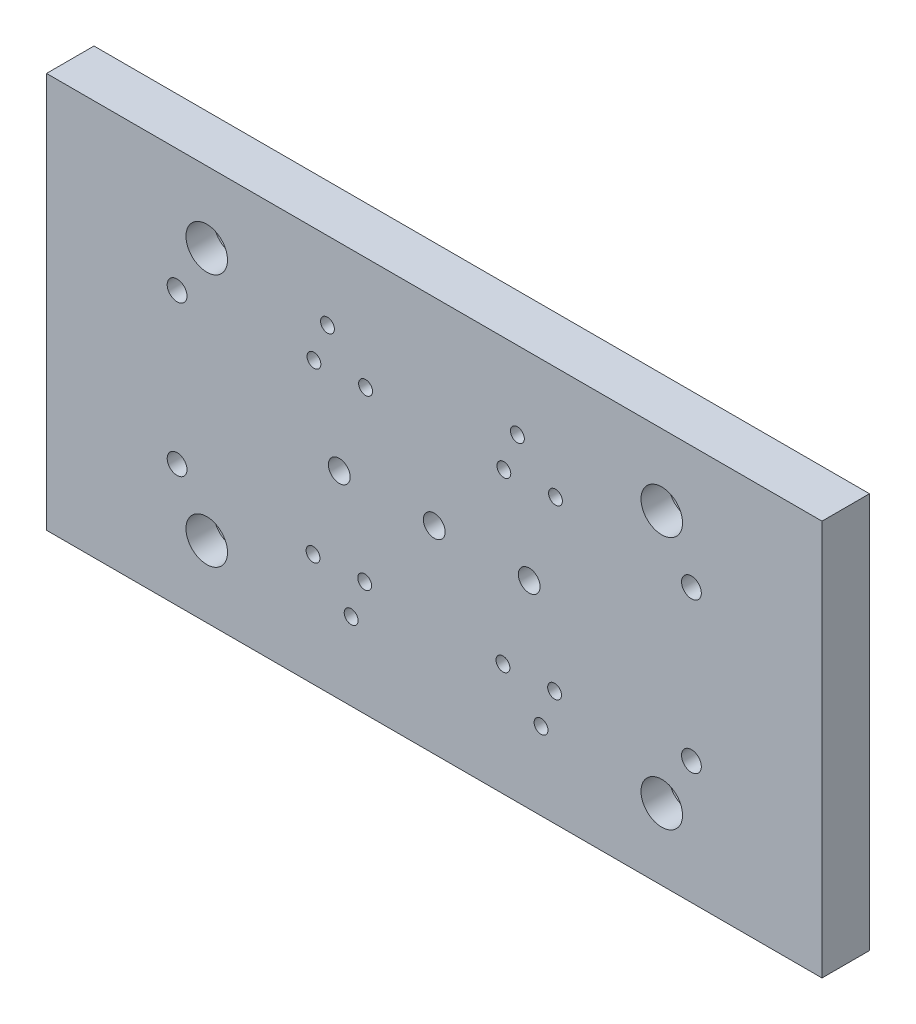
ISO-10303-21;
HEADER;
FILE_DESCRIPTION(('STEP AP214'),'2;1');
FILE_NAME('part.step','',(''),(''),'','','');
FILE_SCHEMA(('AUTOMOTIVE_DESIGN { 1 0 10303 214 1 1 1 1 }'));
ENDSEC;
DATA;
#1=APPLICATION_CONTEXT('core data for automotive mechanical design processes');
#2=APPLICATION_PROTOCOL_DEFINITION('international standard','automotive_design',2000,#1);
#3=PRODUCT_CONTEXT('',#1,'mechanical');
#4=PRODUCT('Part','Part','',(#3));
#5=PRODUCT_RELATED_PRODUCT_CATEGORY('part','',(#4));
#6=PRODUCT_DEFINITION_FORMATION('','',#4);
#7=PRODUCT_DEFINITION_CONTEXT('part definition',#1,'design');
#8=PRODUCT_DEFINITION('design','',#6,#7);
#9=PRODUCT_DEFINITION_SHAPE('','',#8);
#10=(LENGTH_UNIT() NAMED_UNIT(*) SI_UNIT(.MILLI.,.METRE.));
#11=(NAMED_UNIT(*) PLANE_ANGLE_UNIT() SI_UNIT($,.RADIAN.));
#12=(NAMED_UNIT(*) SI_UNIT($,.STERADIAN.) SOLID_ANGLE_UNIT());
#13=UNCERTAINTY_MEASURE_WITH_UNIT(LENGTH_MEASURE(1.E-05),#10,'distance_accuracy_value','');
#14=(GEOMETRIC_REPRESENTATION_CONTEXT(3) GLOBAL_UNCERTAINTY_ASSIGNED_CONTEXT((#13)) GLOBAL_UNIT_ASSIGNED_CONTEXT((#10,
#11,#12)) REPRESENTATION_CONTEXT('',''));
#15=CARTESIAN_POINT('',(0.,0.,0.));
#16=DIRECTION('',(0.,0.,1.));
#17=DIRECTION('',(1.,0.,0.));
#18=AXIS2_PLACEMENT_3D('',#15,#16,#17);
#19=CARTESIAN_POINT('',(40.5,18.,0.));
#20=DIRECTION('',(0.,0.,1.));
#21=DIRECTION('',(1.,0.,0.));
#22=AXIS2_PLACEMENT_3D('',#19,#20,#21);
#23=CYLINDRICAL_SURFACE('',#22,5.25000000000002);
#24=CARTESIAN_POINT('',(40.5,18.,12.));
#25=DIRECTION('',(0.,0.,1.));
#26=DIRECTION('',(1.,0.,0.));
#27=AXIS2_PLACEMENT_3D('',#24,#25,#26);
#28=CIRCLE('',#27,5.25000000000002);
#29=CARTESIAN_POINT('',(45.75,18.,12.));
#30=VERTEX_POINT('',#29);
#31=EDGE_CURVE('E690',#30,#30,#28,.T.);
#32=ORIENTED_EDGE('',*,*,#31,.T.);
#33=EDGE_LOOP('',(#32));
#34=FACE_BOUND('',#33,.T.);
#35=CARTESIAN_POINT('',(40.5,18.,5.));
#36=DIRECTION('',(0.,0.,-1.));
#37=DIRECTION('',(-1.,0.,0.));
#38=AXIS2_PLACEMENT_3D('',#35,#36,#37);
#39=CIRCLE('',#38,5.25000000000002);
#40=CARTESIAN_POINT('',(35.25,18.,5.));
#41=VERTEX_POINT('',#40);
#42=EDGE_CURVE('E522',#41,#41,#39,.F.);
#43=ORIENTED_EDGE('',*,*,#42,.F.);
#44=EDGE_LOOP('',(#43));
#45=FACE_BOUND('',#44,.T.);
#46=ADVANCED_FACE('F367',(#34,#45),#23,.F.);
#47=CARTESIAN_POINT('',(155.5,82.,0.));
#48=DIRECTION('',(0.,0.,1.));
#49=DIRECTION('',(1.,0.,0.));
#50=AXIS2_PLACEMENT_3D('',#47,#48,#49);
#51=CYLINDRICAL_SURFACE('',#50,5.25);
#52=CARTESIAN_POINT('',(155.5,82.,12.));
#53=DIRECTION('',(0.,0.,1.));
#54=DIRECTION('',(1.,0.,0.));
#55=AXIS2_PLACEMENT_3D('',#52,#53,#54);
#56=CIRCLE('',#55,5.25);
#57=CARTESIAN_POINT('',(160.75,82.,12.));
#58=VERTEX_POINT('',#57);
#59=EDGE_CURVE('E427',#58,#58,#56,.T.);
#60=ORIENTED_EDGE('',*,*,#59,.T.);
#61=EDGE_LOOP('',(#60));
#62=FACE_BOUND('',#61,.T.);
#63=CARTESIAN_POINT('',(155.5,82.,5.));
#64=DIRECTION('',(0.,0.,-1.));
#65=DIRECTION('',(-1.,0.,0.));
#66=AXIS2_PLACEMENT_3D('',#63,#64,#65);
#67=CIRCLE('',#66,5.25);
#68=CARTESIAN_POINT('',(150.25,82.,5.));
#69=VERTEX_POINT('',#68);
#70=EDGE_CURVE('E512',#69,#69,#67,.F.);
#71=ORIENTED_EDGE('',*,*,#70,.F.);
#72=EDGE_LOOP('',(#71));
#73=FACE_BOUND('',#72,.T.);
#74=ADVANCED_FACE('F715',(#62,#73),#51,.F.);
#75=CARTESIAN_POINT('',(115.59,71.07,0.));
#76=DIRECTION('',(0.,0.,1.));
#77=DIRECTION('',(1.,0.,0.));
#78=AXIS2_PLACEMENT_3D('',#75,#76,#77);
#79=CYLINDRICAL_SURFACE('',#78,1.75);
#80=CARTESIAN_POINT('',(115.59,71.07,12.));
#81=DIRECTION('',(0.,0.,1.));
#82=DIRECTION('',(1.,0.,0.));
#83=AXIS2_PLACEMENT_3D('',#80,#81,#82);
#84=CIRCLE('',#83,1.75);
#85=CARTESIAN_POINT('',(117.34,71.07,12.));
#86=VERTEX_POINT('',#85);
#87=EDGE_CURVE('E675',#86,#86,#84,.T.);
#88=ORIENTED_EDGE('',*,*,#87,.T.);
#89=EDGE_LOOP('',(#88));
#90=FACE_BOUND('',#89,.T.);
#91=CARTESIAN_POINT('',(115.59,71.07,3.05));
#92=DIRECTION('',(0.,0.,-1.));
#93=DIRECTION('',(-1.,0.,0.));
#94=AXIS2_PLACEMENT_3D('',#91,#92,#93);
#95=CIRCLE('',#94,1.75);
#96=CARTESIAN_POINT('',(113.84,71.07,3.05));
#97=VERTEX_POINT('',#96);
#98=EDGE_CURVE('E507',#97,#97,#95,.F.);
#99=ORIENTED_EDGE('',*,*,#98,.F.);
#100=EDGE_LOOP('',(#99));
#101=FACE_BOUND('',#100,.T.);
#102=ADVANCED_FACE('F722',(#90,#101),#79,.F.);
#103=CARTESIAN_POINT('',(119.01,80.41,0.));
#104=DIRECTION('',(0.,0.,1.));
#105=DIRECTION('',(1.,0.,0.));
#106=AXIS2_PLACEMENT_3D('',#103,#104,#105);
#107=CYLINDRICAL_SURFACE('',#106,1.75);
#108=CARTESIAN_POINT('',(119.01,80.41,12.));
#109=DIRECTION('',(0.,0.,1.));
#110=DIRECTION('',(1.,0.,0.));
#111=AXIS2_PLACEMENT_3D('',#108,#109,#110);
#112=CIRCLE('',#111,1.75);
#113=CARTESIAN_POINT('',(120.76,80.41,12.));
#114=VERTEX_POINT('',#113);
#115=EDGE_CURVE('E681',#114,#114,#112,.T.);
#116=ORIENTED_EDGE('',*,*,#115,.T.);
#117=EDGE_LOOP('',(#116));
#118=FACE_BOUND('',#117,.T.);
#119=CARTESIAN_POINT('',(119.01,80.41,3.05));
#120=DIRECTION('',(0.,0.,-1.));
#121=DIRECTION('',(-1.,0.,0.));
#122=AXIS2_PLACEMENT_3D('',#119,#120,#121);
#123=CIRCLE('',#122,1.75);
#124=CARTESIAN_POINT('',(117.26,80.41,3.05));
#125=VERTEX_POINT('',#124);
#126=EDGE_CURVE('E502',#125,#125,#123,.F.);
#127=ORIENTED_EDGE('',*,*,#126,.F.);
#128=EDGE_LOOP('',(#127));
#129=FACE_BOUND('',#128,.T.);
#130=ADVANCED_FACE('F843',(#118,#129),#107,.F.);
#131=CARTESIAN_POINT('',(128.64,71.58,0.));
#132=DIRECTION('',(0.,0.,1.));
#133=DIRECTION('',(1.,0.,0.));
#134=AXIS2_PLACEMENT_3D('',#131,#132,#133);
#135=CYLINDRICAL_SURFACE('',#134,1.75000000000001);
#136=CARTESIAN_POINT('',(128.64,71.58,12.));
#137=DIRECTION('',(0.,0.,1.));
#138=DIRECTION('',(1.,0.,0.));
#139=AXIS2_PLACEMENT_3D('',#136,#137,#138);
#140=CIRCLE('',#139,1.75000000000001);
#141=CARTESIAN_POINT('',(130.39,71.58,12.));
#142=VERTEX_POINT('',#141);
#143=EDGE_CURVE('E678',#142,#142,#140,.T.);
#144=ORIENTED_EDGE('',*,*,#143,.T.);
#145=EDGE_LOOP('',(#144));
#146=FACE_BOUND('',#145,.T.);
#147=CARTESIAN_POINT('',(128.64,71.58,3.05));
#148=DIRECTION('',(0.,0.,-1.));
#149=DIRECTION('',(-1.,0.,0.));
#150=AXIS2_PLACEMENT_3D('',#147,#148,#149);
#151=CIRCLE('',#150,1.75000000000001);
#152=CARTESIAN_POINT('',(126.89,71.58,3.05));
#153=VERTEX_POINT('',#152);
#154=EDGE_CURVE('E497',#153,#153,#151,.F.);
#155=ORIENTED_EDGE('',*,*,#154,.F.);
#156=EDGE_LOOP('',(#155));
#157=FACE_BOUND('',#156,.T.);
#158=ADVANCED_FACE('F840',(#146,#157),#135,.F.);
#159=CARTESIAN_POINT('',(80.64,71.58,0.));
#160=DIRECTION('',(0.,0.,1.));
#161=DIRECTION('',(1.,0.,0.));
#162=AXIS2_PLACEMENT_3D('',#159,#160,#161);
#163=CYLINDRICAL_SURFACE('',#162,1.75);
#164=CARTESIAN_POINT('',(80.64,71.58,12.));
#165=DIRECTION('',(0.,0.,1.));
#166=DIRECTION('',(1.,0.,0.));
#167=AXIS2_PLACEMENT_3D('',#164,#165,#166);
#168=CIRCLE('',#167,1.75);
#169=CARTESIAN_POINT('',(82.39,71.58,12.));
#170=VERTEX_POINT('',#169);
#171=EDGE_CURVE('E672',#170,#170,#168,.T.);
#172=ORIENTED_EDGE('',*,*,#171,.T.);
#173=EDGE_LOOP('',(#172));
#174=FACE_BOUND('',#173,.T.);
#175=CARTESIAN_POINT('',(80.64,71.58,3.05));
#176=DIRECTION('',(0.,0.,-1.));
#177=DIRECTION('',(-1.,0.,0.));
#178=AXIS2_PLACEMENT_3D('',#175,#176,#177);
#179=CIRCLE('',#178,1.75);
#180=CARTESIAN_POINT('',(78.89,71.58,3.05));
#181=VERTEX_POINT('',#180);
#182=EDGE_CURVE('E492',#181,#181,#179,.F.);
#183=ORIENTED_EDGE('',*,*,#182,.F.);
#184=EDGE_LOOP('',(#183));
#185=FACE_BOUND('',#184,.T.);
#186=ADVANCED_FACE('F836',(#174,#185),#163,.F.);
#187=CARTESIAN_POINT('',(71.01,80.41,0.));
#188=DIRECTION('',(0.,0.,1.));
#189=DIRECTION('',(1.,0.,0.));
#190=AXIS2_PLACEMENT_3D('',#187,#188,#189);
#191=CYLINDRICAL_SURFACE('',#190,1.75);
#192=CARTESIAN_POINT('',(71.01,80.41,12.));
#193=DIRECTION('',(0.,0.,1.));
#194=DIRECTION('',(1.,0.,0.));
#195=AXIS2_PLACEMENT_3D('',#192,#193,#194);
#196=CIRCLE('',#195,1.75);
#197=CARTESIAN_POINT('',(72.76,80.41,12.));
#198=VERTEX_POINT('',#197);
#199=EDGE_CURVE('E669',#198,#198,#196,.T.);
#200=ORIENTED_EDGE('',*,*,#199,.T.);
#201=EDGE_LOOP('',(#200));
#202=FACE_BOUND('',#201,.T.);
#203=CARTESIAN_POINT('',(71.01,80.41,3.05));
#204=DIRECTION('',(0.,0.,-1.));
#205=DIRECTION('',(-1.,0.,0.));
#206=AXIS2_PLACEMENT_3D('',#203,#204,#205);
#207=CIRCLE('',#206,1.75);
#208=CARTESIAN_POINT('',(69.26,80.41,3.05));
#209=VERTEX_POINT('',#208);
#210=EDGE_CURVE('E487',#209,#209,#207,.F.);
#211=ORIENTED_EDGE('',*,*,#210,.F.);
#212=EDGE_LOOP('',(#211));
#213=FACE_BOUND('',#212,.T.);
#214=ADVANCED_FACE('F832',(#202,#213),#191,.F.);
#215=CARTESIAN_POINT('',(67.59,71.01,0.));
#216=DIRECTION('',(0.,0.,1.));
#217=DIRECTION('',(1.,0.,0.));
#218=AXIS2_PLACEMENT_3D('',#215,#216,#217);
#219=CYLINDRICAL_SURFACE('',#218,1.75);
#220=CARTESIAN_POINT('',(67.59,71.01,12.));
#221=DIRECTION('',(0.,0.,1.));
#222=DIRECTION('',(1.,0.,0.));
#223=AXIS2_PLACEMENT_3D('',#220,#221,#222);
#224=CIRCLE('',#223,1.75);
#225=CARTESIAN_POINT('',(69.34,71.01,12.));
#226=VERTEX_POINT('',#225);
#227=EDGE_CURVE('E666',#226,#226,#224,.T.);
#228=ORIENTED_EDGE('',*,*,#227,.T.);
#229=EDGE_LOOP('',(#228));
#230=FACE_BOUND('',#229,.T.);
#231=CARTESIAN_POINT('',(67.59,71.01,3.05));
#232=DIRECTION('',(0.,0.,-1.));
#233=DIRECTION('',(-1.,0.,0.));
#234=AXIS2_PLACEMENT_3D('',#231,#232,#233);
#235=CIRCLE('',#234,1.75);
#236=CARTESIAN_POINT('',(65.84,71.01,3.05));
#237=VERTEX_POINT('',#236);
#238=EDGE_CURVE('E482',#237,#237,#235,.F.);
#239=ORIENTED_EDGE('',*,*,#238,.F.);
#240=EDGE_LOOP('',(#239));
#241=FACE_BOUND('',#240,.T.);
#242=ADVANCED_FACE('F825',(#230,#241),#219,.F.);
#243=CARTESIAN_POINT('',(67.36,28.42,0.));
#244=DIRECTION('',(0.,0.,1.));
#245=DIRECTION('',(1.,0.,0.));
#246=AXIS2_PLACEMENT_3D('',#243,#244,#245);
#247=CYLINDRICAL_SURFACE('',#246,1.75000000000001);
#248=CARTESIAN_POINT('',(67.36,28.42,12.));
#249=DIRECTION('',(0.,0.,1.));
#250=DIRECTION('',(1.,0.,0.));
#251=AXIS2_PLACEMENT_3D('',#248,#249,#250);
#252=CIRCLE('',#251,1.75000000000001);
#253=CARTESIAN_POINT('',(69.11,28.42,12.));
#254=VERTEX_POINT('',#253);
#255=EDGE_CURVE('E660',#254,#254,#252,.T.);
#256=ORIENTED_EDGE('',*,*,#255,.T.);
#257=EDGE_LOOP('',(#256));
#258=FACE_BOUND('',#257,.T.);
#259=CARTESIAN_POINT('',(67.36,28.42,3.05));
#260=DIRECTION('',(0.,0.,-1.));
#261=DIRECTION('',(-1.,0.,0.));
#262=AXIS2_PLACEMENT_3D('',#259,#260,#261);
#263=CIRCLE('',#262,1.75000000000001);
#264=CARTESIAN_POINT('',(65.61,28.42,3.05));
#265=VERTEX_POINT('',#264);
#266=EDGE_CURVE('E477',#265,#265,#263,.F.);
#267=ORIENTED_EDGE('',*,*,#266,.F.);
#268=EDGE_LOOP('',(#267));
#269=FACE_BOUND('',#268,.T.);
#270=ADVANCED_FACE('F822',(#258,#269),#247,.F.);
#271=CARTESIAN_POINT('',(76.99,19.59,0.));
#272=DIRECTION('',(0.,0.,1.));
#273=DIRECTION('',(1.,0.,0.));
#274=AXIS2_PLACEMENT_3D('',#271,#272,#273);
#275=CYLINDRICAL_SURFACE('',#274,1.75);
#276=CARTESIAN_POINT('',(76.99,19.59,12.));
#277=DIRECTION('',(0.,0.,1.));
#278=DIRECTION('',(1.,0.,0.));
#279=AXIS2_PLACEMENT_3D('',#276,#277,#278);
#280=CIRCLE('',#279,1.75);
#281=CARTESIAN_POINT('',(78.74,19.59,12.));
#282=VERTEX_POINT('',#281);
#283=EDGE_CURVE('E663',#282,#282,#280,.T.);
#284=ORIENTED_EDGE('',*,*,#283,.T.);
#285=EDGE_LOOP('',(#284));
#286=FACE_BOUND('',#285,.T.);
#287=CARTESIAN_POINT('',(76.99,19.59,3.05));
#288=DIRECTION('',(0.,0.,-1.));
#289=DIRECTION('',(-1.,0.,0.));
#290=AXIS2_PLACEMENT_3D('',#287,#288,#289);
#291=CIRCLE('',#290,1.75);
#292=CARTESIAN_POINT('',(75.24,19.59,3.05));
#293=VERTEX_POINT('',#292);
#294=EDGE_CURVE('E472',#293,#293,#291,.F.);
#295=ORIENTED_EDGE('',*,*,#294,.F.);
#296=EDGE_LOOP('',(#295));
#297=FACE_BOUND('',#296,.T.);
#298=ADVANCED_FACE('F820',(#286,#297),#275,.F.);
#299=CARTESIAN_POINT('',(80.41,28.93,0.));
#300=DIRECTION('',(0.,0.,1.));
#301=DIRECTION('',(1.,0.,0.));
#302=AXIS2_PLACEMENT_3D('',#299,#300,#301);
#303=CYLINDRICAL_SURFACE('',#302,1.75);
#304=CARTESIAN_POINT('',(80.41,28.93,12.));
#305=DIRECTION('',(0.,0.,1.));
#306=DIRECTION('',(1.,0.,0.));
#307=AXIS2_PLACEMENT_3D('',#304,#305,#306);
#308=CIRCLE('',#307,1.75);
#309=CARTESIAN_POINT('',(82.16,28.93,12.));
#310=VERTEX_POINT('',#309);
#311=EDGE_CURVE('E657',#310,#310,#308,.T.);
#312=ORIENTED_EDGE('',*,*,#311,.T.);
#313=EDGE_LOOP('',(#312));
#314=FACE_BOUND('',#313,.T.);
#315=CARTESIAN_POINT('',(80.41,28.93,3.05));
#316=DIRECTION('',(0.,0.,-1.));
#317=DIRECTION('',(-1.,0.,0.));
#318=AXIS2_PLACEMENT_3D('',#315,#316,#317);
#319=CIRCLE('',#318,1.75);
#320=CARTESIAN_POINT('',(78.66,28.93,3.05));
#321=VERTEX_POINT('',#320);
#322=EDGE_CURVE('E467',#321,#321,#319,.F.);
#323=ORIENTED_EDGE('',*,*,#322,.F.);
#324=EDGE_LOOP('',(#323));
#325=FACE_BOUND('',#324,.T.);
#326=ADVANCED_FACE('F808',(#314,#325),#303,.F.);
#327=CARTESIAN_POINT('',(115.36,28.42,0.));
#328=DIRECTION('',(0.,0.,1.));
#329=DIRECTION('',(1.,0.,0.));
#330=AXIS2_PLACEMENT_3D('',#327,#328,#329);
#331=CYLINDRICAL_SURFACE('',#330,1.75);
#332=CARTESIAN_POINT('',(115.36,28.42,12.));
#333=DIRECTION('',(0.,0.,1.));
#334=DIRECTION('',(1.,0.,0.));
#335=AXIS2_PLACEMENT_3D('',#332,#333,#334);
#336=CIRCLE('',#335,1.75);
#337=CARTESIAN_POINT('',(117.11,28.42,12.));
#338=VERTEX_POINT('',#337);
#339=EDGE_CURVE('E450',#338,#338,#336,.T.);
#340=ORIENTED_EDGE('',*,*,#339,.T.);
#341=EDGE_LOOP('',(#340));
#342=FACE_BOUND('',#341,.T.);
#343=CARTESIAN_POINT('',(115.36,28.42,3.05));
#344=DIRECTION('',(0.,0.,-1.));
#345=DIRECTION('',(-1.,0.,0.));
#346=AXIS2_PLACEMENT_3D('',#343,#344,#345);
#347=CIRCLE('',#346,1.75);
#348=CARTESIAN_POINT('',(113.61,28.42,3.05));
#349=VERTEX_POINT('',#348);
#350=EDGE_CURVE('E462',#349,#349,#347,.F.);
#351=ORIENTED_EDGE('',*,*,#350,.F.);
#352=EDGE_LOOP('',(#351));
#353=FACE_BOUND('',#352,.T.);
#354=ADVANCED_FACE('F804',(#342,#353),#331,.F.);
#355=CARTESIAN_POINT('',(128.41,28.99,0.));
#356=DIRECTION('',(0.,0.,1.));
#357=DIRECTION('',(1.,0.,0.));
#358=AXIS2_PLACEMENT_3D('',#355,#356,#357);
#359=CYLINDRICAL_SURFACE('',#358,1.75000000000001);
#360=CARTESIAN_POINT('',(128.41,28.99,12.));
#361=DIRECTION('',(0.,0.,1.));
#362=DIRECTION('',(1.,0.,0.));
#363=AXIS2_PLACEMENT_3D('',#360,#361,#362);
#364=CIRCLE('',#363,1.75000000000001);
#365=CARTESIAN_POINT('',(130.16,28.99,12.));
#366=VERTEX_POINT('',#365);
#367=EDGE_CURVE('E651',#366,#366,#364,.T.);
#368=ORIENTED_EDGE('',*,*,#367,.T.);
#369=EDGE_LOOP('',(#368));
#370=FACE_BOUND('',#369,.T.);
#371=CARTESIAN_POINT('',(128.41,28.99,3.05));
#372=DIRECTION('',(0.,0.,-1.));
#373=DIRECTION('',(-1.,0.,0.));
#374=AXIS2_PLACEMENT_3D('',#371,#372,#373);
#375=CIRCLE('',#374,1.75000000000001);
#376=CARTESIAN_POINT('',(126.66,28.99,3.05));
#377=VERTEX_POINT('',#376);
#378=EDGE_CURVE('E457',#377,#377,#375,.F.);
#379=ORIENTED_EDGE('',*,*,#378,.F.);
#380=EDGE_LOOP('',(#379));
#381=FACE_BOUND('',#380,.T.);
#382=ADVANCED_FACE('F807',(#370,#381),#359,.F.);
#383=CARTESIAN_POINT('',(124.99,19.59,0.));
#384=DIRECTION('',(0.,0.,1.));
#385=DIRECTION('',(1.,0.,0.));
#386=AXIS2_PLACEMENT_3D('',#383,#384,#385);
#387=CYLINDRICAL_SURFACE('',#386,1.75);
#388=CARTESIAN_POINT('',(124.99,19.59,12.));
#389=DIRECTION('',(0.,0.,1.));
#390=DIRECTION('',(1.,0.,0.));
#391=AXIS2_PLACEMENT_3D('',#388,#389,#390);
#392=CIRCLE('',#391,1.75);
#393=CARTESIAN_POINT('',(126.74,19.59,12.));
#394=VERTEX_POINT('',#393);
#395=EDGE_CURVE('E654',#394,#394,#392,.T.);
#396=ORIENTED_EDGE('',*,*,#395,.T.);
#397=EDGE_LOOP('',(#396));
#398=FACE_BOUND('',#397,.T.);
#399=CARTESIAN_POINT('',(124.99,19.59,3.05));
#400=DIRECTION('',(0.,0.,-1.));
#401=DIRECTION('',(-1.,0.,0.));
#402=AXIS2_PLACEMENT_3D('',#399,#400,#401);
#403=CIRCLE('',#402,1.75);
#404=CARTESIAN_POINT('',(123.24,19.59,3.05));
#405=VERTEX_POINT('',#404);
#406=EDGE_CURVE('E452',#405,#405,#403,.F.);
#407=ORIENTED_EDGE('',*,*,#406,.F.);
#408=EDGE_LOOP('',(#407));
#409=FACE_BOUND('',#408,.T.);
#410=ADVANCED_FACE('F812',(#398,#409),#387,.F.);
#411=CARTESIAN_POINT('',(98.,50.,0.));
#412=DIRECTION('',(0.,0.,1.));
#413=DIRECTION('',(1.,0.,0.));
#414=AXIS2_PLACEMENT_3D('',#411,#412,#413);
#415=CYLINDRICAL_SURFACE('',#414,2.75000000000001);
#416=CARTESIAN_POINT('',(98.,50.,12.));
#417=DIRECTION('',(0.,0.,1.));
#418=DIRECTION('',(1.,0.,0.));
#419=AXIS2_PLACEMENT_3D('',#416,#417,#418);
#420=CIRCLE('',#419,2.75000000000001);
#421=CARTESIAN_POINT('',(100.75,50.,12.));
#422=VERTEX_POINT('',#421);
#423=EDGE_CURVE('E684',#422,#422,#420,.T.);
#424=ORIENTED_EDGE('',*,*,#423,.T.);
#425=EDGE_LOOP('',(#424));
#426=FACE_BOUND('',#425,.T.);
#427=CARTESIAN_POINT('',(98.,50.,3.05));
#428=DIRECTION('',(0.,0.,-1.));
#429=DIRECTION('',(-1.,0.,0.));
#430=AXIS2_PLACEMENT_3D('',#427,#428,#429);
#431=CIRCLE('',#430,2.75000000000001);
#432=CARTESIAN_POINT('',(95.25,50.,3.05));
#433=VERTEX_POINT('',#432);
#434=EDGE_CURVE('E447',#433,#433,#431,.F.);
#435=ORIENTED_EDGE('',*,*,#434,.F.);
#436=EDGE_LOOP('',(#435));
#437=FACE_BOUND('',#436,.T.);
#438=ADVANCED_FACE('F816',(#426,#437),#415,.F.);
#439=CARTESIAN_POINT('',(0.,0.,12.));
#440=DIRECTION('',(1.,0.,0.));
#441=DIRECTION('',(0.,1.,0.));
#442=AXIS2_PLACEMENT_3D('',#439,#440,#441);
#443=PLANE('',#442);
#444=DIRECTION('',(0.,-1.,0.));
#445=VECTOR('',#444,1.);
#446=CARTESIAN_POINT('',(0.,0.,0.));
#447=LINE('',#446,#445);
#448=CARTESIAN_POINT('',(0.,100.,0.));
#449=VERTEX_POINT('',#448);
#450=CARTESIAN_POINT('',(0.,0.,0.));
#451=VERTEX_POINT('',#450);
#452=EDGE_CURVE('E414',#449,#451,#447,.T.);
#453=ORIENTED_EDGE('',*,*,#452,.T.);
#454=DIRECTION('',(0.,0.,-1.));
#455=VECTOR('',#454,1.);
#456=CARTESIAN_POINT('',(0.,0.,12.));
#457=LINE('',#456,#455);
#458=CARTESIAN_POINT('',(0.,0.,12.));
#459=VERTEX_POINT('',#458);
#460=EDGE_CURVE('E11',#459,#451,#457,.T.);
#461=ORIENTED_EDGE('',*,*,#460,.F.);
#462=DIRECTION('',(0.,-1.,0.));
#463=VECTOR('',#462,1.);
#464=CARTESIAN_POINT('',(0.,0.,12.));
#465=LINE('',#464,#463);
#466=CARTESIAN_POINT('',(0.,100.,12.));
#467=VERTEX_POINT('',#466);
#468=EDGE_CURVE('E437',#467,#459,#465,.T.);
#469=ORIENTED_EDGE('',*,*,#468,.F.);
#470=DIRECTION('',(0.,0.,-1.));
#471=VECTOR('',#470,1.);
#472=CARTESIAN_POINT('',(0.,100.,12.));
#473=LINE('',#472,#471);
#474=EDGE_CURVE('E426',#467,#449,#473,.T.);
#475=ORIENTED_EDGE('',*,*,#474,.T.);
#476=EDGE_LOOP('',(#453,#461,#469,#475));
#477=FACE_BOUND('',#476,.T.);
#478=ADVANCED_FACE('F369',(#477),#443,.F.);
#479=CARTESIAN_POINT('',(0.,0.,12.));
#480=DIRECTION('',(0.,1.,0.));
#481=DIRECTION('',(0.,0.,1.));
#482=AXIS2_PLACEMENT_3D('',#479,#480,#481);
#483=PLANE('',#482);
#484=DIRECTION('',(1.,0.,0.));
#485=VECTOR('',#484,1.);
#486=CARTESIAN_POINT('',(0.,0.,0.));
#487=LINE('',#486,#485);
#488=CARTESIAN_POINT('',(196.,0.,0.));
#489=VERTEX_POINT('',#488);
#490=EDGE_CURVE('E410',#451,#489,#487,.T.);
#491=ORIENTED_EDGE('',*,*,#490,.T.);
#492=DIRECTION('',(0.,0.,-1.));
#493=VECTOR('',#492,1.);
#494=CARTESIAN_POINT('',(196.,0.,12.));
#495=LINE('',#494,#493);
#496=CARTESIAN_POINT('',(196.,0.,12.));
#497=VERTEX_POINT('',#496);
#498=EDGE_CURVE('E376',#497,#489,#495,.T.);
#499=ORIENTED_EDGE('',*,*,#498,.F.);
#500=DIRECTION('',(1.,0.,0.));
#501=VECTOR('',#500,1.);
#502=CARTESIAN_POINT('',(0.,0.,12.));
#503=LINE('',#502,#501);
#504=EDGE_CURVE('E422',#459,#497,#503,.T.);
#505=ORIENTED_EDGE('',*,*,#504,.F.);
#506=ORIENTED_EDGE('',*,*,#460,.T.);
#507=EDGE_LOOP('',(#491,#499,#505,#506));
#508=FACE_BOUND('',#507,.T.);
#509=ADVANCED_FACE('F421',(#508),#483,.F.);
#510=CARTESIAN_POINT('',(196.,0.,12.));
#511=DIRECTION('',(-1.,0.,0.));
#512=DIRECTION('',(0.,-1.,0.));
#513=AXIS2_PLACEMENT_3D('',#510,#511,#512);
#514=PLANE('',#513);
#515=DIRECTION('',(0.,1.,0.));
#516=VECTOR('',#515,1.);
#517=CARTESIAN_POINT('',(196.,0.,0.));
#518=LINE('',#517,#516);
#519=CARTESIAN_POINT('',(196.,100.,0.));
#520=VERTEX_POINT('',#519);
#521=EDGE_CURVE('E415',#489,#520,#518,.T.);
#522=ORIENTED_EDGE('',*,*,#521,.T.);
#523=DIRECTION('',(0.,0.,-1.));
#524=VECTOR('',#523,1.);
#525=CARTESIAN_POINT('',(196.,100.,12.));
#526=LINE('',#525,#524);
#527=CARTESIAN_POINT('',(196.,100.,12.));
#528=VERTEX_POINT('',#527);
#529=EDGE_CURVE('E443',#528,#520,#526,.T.);
#530=ORIENTED_EDGE('',*,*,#529,.F.);
#531=DIRECTION('',(0.,1.,0.));
#532=VECTOR('',#531,1.);
#533=CARTESIAN_POINT('',(196.,0.,12.));
#534=LINE('',#533,#532);
#535=EDGE_CURVE('E389',#497,#528,#534,.T.);
#536=ORIENTED_EDGE('',*,*,#535,.F.);
#537=ORIENTED_EDGE('',*,*,#498,.T.);
#538=EDGE_LOOP('',(#522,#530,#536,#537));
#539=FACE_BOUND('',#538,.T.);
#540=ADVANCED_FACE('F705',(#539),#514,.F.);
#541=CARTESIAN_POINT('',(0.,100.,12.));
#542=DIRECTION('',(0.,-1.,0.));
#543=DIRECTION('',(0.,0.,-1.));
#544=AXIS2_PLACEMENT_3D('',#541,#542,#543);
#545=PLANE('',#544);
#546=DIRECTION('',(-1.,0.,0.));
#547=VECTOR('',#546,1.);
#548=CARTESIAN_POINT('',(0.,100.,0.));
#549=LINE('',#548,#547);
#550=EDGE_CURVE('E435',#520,#449,#549,.T.);
#551=ORIENTED_EDGE('',*,*,#550,.T.);
#552=ORIENTED_EDGE('',*,*,#474,.F.);
#553=DIRECTION('',(-1.,0.,0.));
#554=VECTOR('',#553,1.);
#555=CARTESIAN_POINT('',(0.,100.,12.));
#556=LINE('',#555,#554);
#557=EDGE_CURVE('E384',#528,#467,#556,.T.);
#558=ORIENTED_EDGE('',*,*,#557,.F.);
#559=ORIENTED_EDGE('',*,*,#529,.T.);
#560=EDGE_LOOP('',(#551,#552,#558,#559));
#561=FACE_BOUND('',#560,.T.);
#562=ADVANCED_FACE('F700',(#561),#545,.F.);
#563=CARTESIAN_POINT('',(0.,100.,12.));
#564=DIRECTION('',(0.,0.,-1.));
#565=DIRECTION('',(-1.,0.,0.));
#566=AXIS2_PLACEMENT_3D('',#563,#564,#565);
#567=PLANE('',#566);
#568=CARTESIAN_POINT('',(122.,50.,12.));
#569=DIRECTION('',(0.,0.,-1.));
#570=DIRECTION('',(-1.,0.,0.));
#571=AXIS2_PLACEMENT_3D('',#568,#569,#570);
#572=CIRCLE('',#571,2.75000000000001);
#573=CARTESIAN_POINT('',(119.25,50.,12.));
#574=VERTEX_POINT('',#573);
#575=EDGE_CURVE('E545',#574,#574,#572,.T.);
#576=ORIENTED_EDGE('',*,*,#575,.T.);
#577=EDGE_LOOP('',(#576));
#578=FACE_BOUND('',#577,.T.);
#579=CARTESIAN_POINT('',(74.,50.,12.));
#580=DIRECTION('',(0.,0.,-1.));
#581=DIRECTION('',(-1.,0.,0.));
#582=AXIS2_PLACEMENT_3D('',#579,#580,#581);
#583=CIRCLE('',#582,2.75000000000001);
#584=CARTESIAN_POINT('',(71.25,50.,12.));
#585=VERTEX_POINT('',#584);
#586=EDGE_CURVE('E534',#585,#585,#583,.T.);
#587=ORIENTED_EDGE('',*,*,#586,.T.);
#588=EDGE_LOOP('',(#587));
#589=FACE_BOUND('',#588,.T.);
#590=CARTESIAN_POINT('',(33.,69.,12.));
#591=DIRECTION('',(0.,0.,-1.));
#592=DIRECTION('',(-1.,0.,0.));
#593=AXIS2_PLACEMENT_3D('',#590,#591,#592);
#594=CIRCLE('',#593,2.5);
#595=CARTESIAN_POINT('',(30.5,69.,12.));
#596=VERTEX_POINT('',#595);
#597=EDGE_CURVE('E556',#596,#596,#594,.T.);
#598=ORIENTED_EDGE('',*,*,#597,.T.);
#599=EDGE_LOOP('',(#598));
#600=FACE_BOUND('',#599,.T.);
#601=CARTESIAN_POINT('',(163.,69.,12.));
#602=DIRECTION('',(0.,0.,-1.));
#603=DIRECTION('',(-1.,0.,0.));
#604=AXIS2_PLACEMENT_3D('',#601,#602,#603);
#605=CIRCLE('',#604,2.5);
#606=CARTESIAN_POINT('',(160.5,69.,12.));
#607=VERTEX_POINT('',#606);
#608=EDGE_CURVE('E562',#607,#607,#605,.T.);
#609=ORIENTED_EDGE('',*,*,#608,.T.);
#610=EDGE_LOOP('',(#609));
#611=FACE_BOUND('',#610,.T.);
#612=CARTESIAN_POINT('',(163.,31.,12.));
#613=DIRECTION('',(0.,0.,-1.));
#614=DIRECTION('',(-1.,0.,0.));
#615=AXIS2_PLACEMENT_3D('',#612,#613,#614);
#616=CIRCLE('',#615,2.5);
#617=CARTESIAN_POINT('',(160.5,31.,12.));
#618=VERTEX_POINT('',#617);
#619=EDGE_CURVE('E568',#618,#618,#616,.T.);
#620=ORIENTED_EDGE('',*,*,#619,.T.);
#621=EDGE_LOOP('',(#620));
#622=FACE_BOUND('',#621,.T.);
#623=CARTESIAN_POINT('',(33.,31.,12.));
#624=DIRECTION('',(0.,0.,-1.));
#625=DIRECTION('',(-1.,0.,0.));
#626=AXIS2_PLACEMENT_3D('',#623,#624,#625);
#627=CIRCLE('',#626,2.5);
#628=CARTESIAN_POINT('',(30.5,31.,12.));
#629=VERTEX_POINT('',#628);
#630=EDGE_CURVE('E574',#629,#629,#627,.T.);
#631=ORIENTED_EDGE('',*,*,#630,.T.);
#632=EDGE_LOOP('',(#631));
#633=FACE_BOUND('',#632,.T.);
#634=ORIENTED_EDGE('',*,*,#339,.F.);
#635=EDGE_LOOP('',(#634));
#636=FACE_BOUND('',#635,.T.);
#637=ORIENTED_EDGE('',*,*,#367,.F.);
#638=EDGE_LOOP('',(#637));
#639=FACE_BOUND('',#638,.T.);
#640=ORIENTED_EDGE('',*,*,#395,.F.);
#641=EDGE_LOOP('',(#640));
#642=FACE_BOUND('',#641,.T.);
#643=ORIENTED_EDGE('',*,*,#311,.F.);
#644=EDGE_LOOP('',(#643));
#645=FACE_BOUND('',#644,.T.);
#646=ORIENTED_EDGE('',*,*,#255,.F.);
#647=EDGE_LOOP('',(#646));
#648=FACE_BOUND('',#647,.T.);
#649=ORIENTED_EDGE('',*,*,#283,.F.);
#650=EDGE_LOOP('',(#649));
#651=FACE_BOUND('',#650,.T.);
#652=ORIENTED_EDGE('',*,*,#227,.F.);
#653=EDGE_LOOP('',(#652));
#654=FACE_BOUND('',#653,.T.);
#655=ORIENTED_EDGE('',*,*,#199,.F.);
#656=EDGE_LOOP('',(#655));
#657=FACE_BOUND('',#656,.T.);
#658=ORIENTED_EDGE('',*,*,#171,.F.);
#659=EDGE_LOOP('',(#658));
#660=FACE_BOUND('',#659,.T.);
#661=ORIENTED_EDGE('',*,*,#87,.F.);
#662=EDGE_LOOP('',(#661));
#663=FACE_BOUND('',#662,.T.);
#664=ORIENTED_EDGE('',*,*,#143,.F.);
#665=EDGE_LOOP('',(#664));
#666=FACE_BOUND('',#665,.T.);
#667=ORIENTED_EDGE('',*,*,#115,.F.);
#668=EDGE_LOOP('',(#667));
#669=FACE_BOUND('',#668,.T.);
#670=ORIENTED_EDGE('',*,*,#423,.F.);
#671=EDGE_LOOP('',(#670));
#672=FACE_BOUND('',#671,.T.);
#673=CARTESIAN_POINT('',(155.5,18.,12.));
#674=DIRECTION('',(0.,0.,1.));
#675=DIRECTION('',(-1.,0.,0.));
#676=AXIS2_PLACEMENT_3D('',#673,#674,#675);
#677=CIRCLE('',#676,5.25);
#678=CARTESIAN_POINT('',(150.25,18.,12.));
#679=VERTEX_POINT('',#678);
#680=EDGE_CURVE('E687',#679,#679,#677,.T.);
#681=ORIENTED_EDGE('',*,*,#680,.F.);
#682=EDGE_LOOP('',(#681));
#683=FACE_BOUND('',#682,.T.);
#684=ORIENTED_EDGE('',*,*,#31,.F.);
#685=EDGE_LOOP('',(#684));
#686=FACE_BOUND('',#685,.T.);
#687=CARTESIAN_POINT('',(40.5,82.,12.));
#688=DIRECTION('',(0.,0.,1.));
#689=DIRECTION('',(-1.,0.,0.));
#690=AXIS2_PLACEMENT_3D('',#687,#688,#689);
#691=CIRCLE('',#690,5.25000000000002);
#692=CARTESIAN_POINT('',(35.25,82.,12.));
#693=VERTEX_POINT('',#692);
#694=EDGE_CURVE('E430',#693,#693,#691,.T.);
#695=ORIENTED_EDGE('',*,*,#694,.F.);
#696=EDGE_LOOP('',(#695));
#697=FACE_BOUND('',#696,.T.);
#698=ORIENTED_EDGE('',*,*,#59,.F.);
#699=EDGE_LOOP('',(#698));
#700=FACE_BOUND('',#699,.T.);
#701=ORIENTED_EDGE('',*,*,#468,.T.);
#702=ORIENTED_EDGE('',*,*,#504,.T.);
#703=ORIENTED_EDGE('',*,*,#535,.T.);
#704=ORIENTED_EDGE('',*,*,#557,.T.);
#705=EDGE_LOOP('',(#701,#702,#703,#704));
#706=FACE_BOUND('',#705,.T.);
#707=ADVANCED_FACE('F697',(#578,#589,#600,#611,#622,#633,#636,#639,#642,#645,#648,#651,#654,
#657,#660,#663,#666,#669,#672,#683,#686,#697,#700,#706),#567,.F.);
#708=CARTESIAN_POINT('',(0.,100.,0.));
#709=DIRECTION('',(0.,0.,-1.));
#710=DIRECTION('',(-1.,0.,0.));
#711=AXIS2_PLACEMENT_3D('',#708,#709,#710);
#712=PLANE('',#711);
#713=CARTESIAN_POINT('',(122.,50.,0.));
#714=DIRECTION('',(0.,0.,-1.));
#715=DIRECTION('',(0.,1.,0.));
#716=AXIS2_PLACEMENT_3D('',#713,#714,#715);
#717=CIRCLE('',#716,5.5);
#718=CARTESIAN_POINT('',(122.,55.5,0.));
#719=VERTEX_POINT('',#718);
#720=EDGE_CURVE('E533',#719,#719,#717,.T.);
#721=ORIENTED_EDGE('',*,*,#720,.F.);
#722=EDGE_LOOP('',(#721));
#723=FACE_BOUND('',#722,.T.);
#724=CARTESIAN_POINT('',(74.,50.,0.));
#725=DIRECTION('',(0.,0.,-1.));
#726=DIRECTION('',(0.,1.,0.));
#727=AXIS2_PLACEMENT_3D('',#724,#725,#726);
#728=CIRCLE('',#727,5.5);
#729=CARTESIAN_POINT('',(74.,55.5,0.));
#730=VERTEX_POINT('',#729);
#731=EDGE_CURVE('E550',#730,#730,#728,.T.);
#732=ORIENTED_EDGE('',*,*,#731,.F.);
#733=EDGE_LOOP('',(#732));
#734=FACE_BOUND('',#733,.T.);
#735=CARTESIAN_POINT('',(33.,69.,0.));
#736=DIRECTION('',(0.,0.,-1.));
#737=DIRECTION('',(-1.,0.,0.));
#738=AXIS2_PLACEMENT_3D('',#735,#736,#737);
#739=CIRCLE('',#738,2.49999999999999);
#740=CARTESIAN_POINT('',(30.5,69.,0.));
#741=VERTEX_POINT('',#740);
#742=EDGE_CURVE('E559',#741,#741,#739,.T.);
#743=ORIENTED_EDGE('',*,*,#742,.F.);
#744=EDGE_LOOP('',(#743));
#745=FACE_BOUND('',#744,.T.);
#746=CARTESIAN_POINT('',(163.,69.,0.));
#747=DIRECTION('',(0.,0.,-1.));
#748=DIRECTION('',(-1.,0.,0.));
#749=AXIS2_PLACEMENT_3D('',#746,#747,#748);
#750=CIRCLE('',#749,2.5);
#751=CARTESIAN_POINT('',(160.5,69.,0.));
#752=VERTEX_POINT('',#751);
#753=EDGE_CURVE('E565',#752,#752,#750,.T.);
#754=ORIENTED_EDGE('',*,*,#753,.F.);
#755=EDGE_LOOP('',(#754));
#756=FACE_BOUND('',#755,.T.);
#757=CARTESIAN_POINT('',(163.,31.,0.));
#758=DIRECTION('',(0.,0.,-1.));
#759=DIRECTION('',(-1.,0.,0.));
#760=AXIS2_PLACEMENT_3D('',#757,#758,#759);
#761=CIRCLE('',#760,2.5);
#762=CARTESIAN_POINT('',(160.5,31.,0.));
#763=VERTEX_POINT('',#762);
#764=EDGE_CURVE('E571',#763,#763,#761,.T.);
#765=ORIENTED_EDGE('',*,*,#764,.F.);
#766=EDGE_LOOP('',(#765));
#767=FACE_BOUND('',#766,.T.);
#768=CARTESIAN_POINT('',(33.,31.,0.));
#769=DIRECTION('',(0.,0.,-1.));
#770=DIRECTION('',(-1.,0.,0.));
#771=AXIS2_PLACEMENT_3D('',#768,#769,#770);
#772=CIRCLE('',#771,2.49999999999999);
#773=CARTESIAN_POINT('',(30.5,31.,0.));
#774=VERTEX_POINT('',#773);
#775=EDGE_CURVE('E577',#774,#774,#772,.T.);
#776=ORIENTED_EDGE('',*,*,#775,.F.);
#777=EDGE_LOOP('',(#776));
#778=FACE_BOUND('',#777,.T.);
#779=CARTESIAN_POINT('',(155.5,18.,0.));
#780=DIRECTION('',(0.,0.,-1.));
#781=DIRECTION('',(1.,0.,0.));
#782=AXIS2_PLACEMENT_3D('',#779,#780,#781);
#783=CIRCLE('',#782,8.50000000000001);
#784=CARTESIAN_POINT('',(164.,18.,0.));
#785=VERTEX_POINT('',#784);
#786=EDGE_CURVE('E580',#785,#785,#783,.T.);
#787=ORIENTED_EDGE('',*,*,#786,.F.);
#788=EDGE_LOOP('',(#787));
#789=FACE_BOUND('',#788,.T.);
#790=CARTESIAN_POINT('',(40.5,18.,0.));
#791=DIRECTION('',(0.,0.,-1.));
#792=DIRECTION('',(-1.,0.,0.));
#793=AXIS2_PLACEMENT_3D('',#790,#791,#792);
#794=CIRCLE('',#793,8.50000000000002);
#795=CARTESIAN_POINT('',(32.,18.,0.));
#796=VERTEX_POINT('',#795);
#797=EDGE_CURVE('E529',#796,#796,#794,.T.);
#798=ORIENTED_EDGE('',*,*,#797,.F.);
#799=EDGE_LOOP('',(#798));
#800=FACE_BOUND('',#799,.T.);
#801=CARTESIAN_POINT('',(40.5,82.,0.));
#802=DIRECTION('',(0.,0.,-1.));
#803=DIRECTION('',(1.,0.,0.));
#804=AXIS2_PLACEMENT_3D('',#801,#802,#803);
#805=CIRCLE('',#804,8.50000000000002);
#806=CARTESIAN_POINT('',(49.,82.,0.));
#807=VERTEX_POINT('',#806);
#808=EDGE_CURVE('E525',#807,#807,#805,.T.);
#809=ORIENTED_EDGE('',*,*,#808,.F.);
#810=EDGE_LOOP('',(#809));
#811=FACE_BOUND('',#810,.T.);
#812=CARTESIAN_POINT('',(155.5,82.,0.));
#813=DIRECTION('',(0.,0.,-1.));
#814=DIRECTION('',(-1.,0.,0.));
#815=AXIS2_PLACEMENT_3D('',#812,#813,#814);
#816=CIRCLE('',#815,8.50000000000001);
#817=CARTESIAN_POINT('',(147.,82.,0.));
#818=VERTEX_POINT('',#817);
#819=EDGE_CURVE('E520',#818,#818,#816,.T.);
#820=ORIENTED_EDGE('',*,*,#819,.F.);
#821=EDGE_LOOP('',(#820));
#822=FACE_BOUND('',#821,.T.);
#823=CARTESIAN_POINT('',(115.59,71.07,0.));
#824=DIRECTION('',(0.,0.,-1.));
#825=DIRECTION('',(-1.,0.,0.));
#826=AXIS2_PLACEMENT_3D('',#823,#824,#825);
#827=CIRCLE('',#826,3.50000000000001);
#828=CARTESIAN_POINT('',(112.09,71.07,0.));
#829=VERTEX_POINT('',#828);
#830=EDGE_CURVE('E515',#829,#829,#827,.T.);
#831=ORIENTED_EDGE('',*,*,#830,.F.);
#832=EDGE_LOOP('',(#831));
#833=FACE_BOUND('',#832,.T.);
#834=CARTESIAN_POINT('',(119.01,80.41,0.));
#835=DIRECTION('',(0.,0.,-1.));
#836=DIRECTION('',(-1.,0.,0.));
#837=AXIS2_PLACEMENT_3D('',#834,#835,#836);
#838=CIRCLE('',#837,3.50000000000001);
#839=CARTESIAN_POINT('',(115.51,80.41,0.));
#840=VERTEX_POINT('',#839);
#841=EDGE_CURVE('E510',#840,#840,#838,.T.);
#842=ORIENTED_EDGE('',*,*,#841,.F.);
#843=EDGE_LOOP('',(#842));
#844=FACE_BOUND('',#843,.T.);
#845=CARTESIAN_POINT('',(128.64,71.58,0.));
#846=DIRECTION('',(0.,0.,-1.));
#847=DIRECTION('',(-1.,0.,0.));
#848=AXIS2_PLACEMENT_3D('',#845,#846,#847);
#849=CIRCLE('',#848,3.49999999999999);
#850=CARTESIAN_POINT('',(125.14,71.58,0.));
#851=VERTEX_POINT('',#850);
#852=EDGE_CURVE('E505',#851,#851,#849,.T.);
#853=ORIENTED_EDGE('',*,*,#852,.F.);
#854=EDGE_LOOP('',(#853));
#855=FACE_BOUND('',#854,.T.);
#856=CARTESIAN_POINT('',(80.64,71.58,0.));
#857=DIRECTION('',(0.,0.,-1.));
#858=DIRECTION('',(-1.,0.,0.));
#859=AXIS2_PLACEMENT_3D('',#856,#857,#858);
#860=CIRCLE('',#859,3.50000000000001);
#861=CARTESIAN_POINT('',(77.14,71.58,0.));
#862=VERTEX_POINT('',#861);
#863=EDGE_CURVE('E500',#862,#862,#860,.T.);
#864=ORIENTED_EDGE('',*,*,#863,.F.);
#865=EDGE_LOOP('',(#864));
#866=FACE_BOUND('',#865,.T.);
#867=CARTESIAN_POINT('',(71.01,80.41,0.));
#868=DIRECTION('',(0.,0.,-1.));
#869=DIRECTION('',(-1.,0.,0.));
#870=AXIS2_PLACEMENT_3D('',#867,#868,#869);
#871=CIRCLE('',#870,3.50000000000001);
#872=CARTESIAN_POINT('',(67.51,80.41,0.));
#873=VERTEX_POINT('',#872);
#874=EDGE_CURVE('E495',#873,#873,#871,.T.);
#875=ORIENTED_EDGE('',*,*,#874,.F.);
#876=EDGE_LOOP('',(#875));
#877=FACE_BOUND('',#876,.T.);
#878=CARTESIAN_POINT('',(67.59,71.01,0.));
#879=DIRECTION('',(0.,0.,-1.));
#880=DIRECTION('',(-1.,0.,0.));
#881=AXIS2_PLACEMENT_3D('',#878,#879,#880);
#882=CIRCLE('',#881,3.50000000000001);
#883=CARTESIAN_POINT('',(64.09,71.01,0.));
#884=VERTEX_POINT('',#883);
#885=EDGE_CURVE('E490',#884,#884,#882,.T.);
#886=ORIENTED_EDGE('',*,*,#885,.F.);
#887=EDGE_LOOP('',(#886));
#888=FACE_BOUND('',#887,.T.);
#889=CARTESIAN_POINT('',(67.36,28.42,0.));
#890=DIRECTION('',(0.,0.,-1.));
#891=DIRECTION('',(-1.,0.,0.));
#892=AXIS2_PLACEMENT_3D('',#889,#890,#891);
#893=CIRCLE('',#892,3.50000000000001);
#894=CARTESIAN_POINT('',(63.86,28.42,0.));
#895=VERTEX_POINT('',#894);
#896=EDGE_CURVE('E485',#895,#895,#893,.T.);
#897=ORIENTED_EDGE('',*,*,#896,.F.);
#898=EDGE_LOOP('',(#897));
#899=FACE_BOUND('',#898,.T.);
#900=CARTESIAN_POINT('',(76.99,19.59,0.));
#901=DIRECTION('',(0.,0.,-1.));
#902=DIRECTION('',(-1.,0.,0.));
#903=AXIS2_PLACEMENT_3D('',#900,#901,#902);
#904=CIRCLE('',#903,3.50000000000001);
#905=CARTESIAN_POINT('',(73.49,19.59,0.));
#906=VERTEX_POINT('',#905);
#907=EDGE_CURVE('E480',#906,#906,#904,.T.);
#908=ORIENTED_EDGE('',*,*,#907,.F.);
#909=EDGE_LOOP('',(#908));
#910=FACE_BOUND('',#909,.T.);
#911=CARTESIAN_POINT('',(80.41,28.93,0.));
#912=DIRECTION('',(0.,0.,-1.));
#913=DIRECTION('',(-1.,0.,0.));
#914=AXIS2_PLACEMENT_3D('',#911,#912,#913);
#915=CIRCLE('',#914,3.50000000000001);
#916=CARTESIAN_POINT('',(76.91,28.93,0.));
#917=VERTEX_POINT('',#916);
#918=EDGE_CURVE('E475',#917,#917,#915,.T.);
#919=ORIENTED_EDGE('',*,*,#918,.F.);
#920=EDGE_LOOP('',(#919));
#921=FACE_BOUND('',#920,.T.);
#922=CARTESIAN_POINT('',(115.36,28.42,0.));
#923=DIRECTION('',(0.,0.,-1.));
#924=DIRECTION('',(-1.,0.,0.));
#925=AXIS2_PLACEMENT_3D('',#922,#923,#924);
#926=CIRCLE('',#925,3.50000000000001);
#927=CARTESIAN_POINT('',(111.86,28.42,0.));
#928=VERTEX_POINT('',#927);
#929=EDGE_CURVE('E470',#928,#928,#926,.T.);
#930=ORIENTED_EDGE('',*,*,#929,.F.);
#931=EDGE_LOOP('',(#930));
#932=FACE_BOUND('',#931,.T.);
#933=CARTESIAN_POINT('',(128.41,28.99,0.));
#934=DIRECTION('',(0.,0.,-1.));
#935=DIRECTION('',(-1.,0.,0.));
#936=AXIS2_PLACEMENT_3D('',#933,#934,#935);
#937=CIRCLE('',#936,3.49999999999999);
#938=CARTESIAN_POINT('',(124.91,28.99,0.));
#939=VERTEX_POINT('',#938);
#940=EDGE_CURVE('E465',#939,#939,#937,.T.);
#941=ORIENTED_EDGE('',*,*,#940,.F.);
#942=EDGE_LOOP('',(#941));
#943=FACE_BOUND('',#942,.T.);
#944=CARTESIAN_POINT('',(124.99,19.59,0.));
#945=DIRECTION('',(0.,0.,-1.));
#946=DIRECTION('',(-1.,0.,0.));
#947=AXIS2_PLACEMENT_3D('',#944,#945,#946);
#948=CIRCLE('',#947,3.50000000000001);
#949=CARTESIAN_POINT('',(121.49,19.59,0.));
#950=VERTEX_POINT('',#949);
#951=EDGE_CURVE('E460',#950,#950,#948,.T.);
#952=ORIENTED_EDGE('',*,*,#951,.F.);
#953=EDGE_LOOP('',(#952));
#954=FACE_BOUND('',#953,.T.);
#955=CARTESIAN_POINT('',(98.,50.,0.));
#956=DIRECTION('',(0.,0.,-1.));
#957=DIRECTION('',(-1.,0.,0.));
#958=AXIS2_PLACEMENT_3D('',#955,#956,#957);
#959=CIRCLE('',#958,5.5);
#960=CARTESIAN_POINT('',(92.5,50.,0.));
#961=VERTEX_POINT('',#960);
#962=EDGE_CURVE('E455',#961,#961,#959,.T.);
#963=ORIENTED_EDGE('',*,*,#962,.F.);
#964=EDGE_LOOP('',(#963));
#965=FACE_BOUND('',#964,.T.);
#966=ORIENTED_EDGE('',*,*,#452,.F.);
#967=ORIENTED_EDGE('',*,*,#550,.F.);
#968=ORIENTED_EDGE('',*,*,#521,.F.);
#969=ORIENTED_EDGE('',*,*,#490,.F.);
#970=EDGE_LOOP('',(#966,#967,#968,#969));
#971=FACE_BOUND('',#970,.T.);
#972=ADVANCED_FACE('F411',(#723,#734,#745,#756,#767,#778,#789,#800,#811,#822,#833,#844,#855,
#866,#877,#888,#899,#910,#921,#932,#943,#954,#965,#971),#712,.T.);
#973=CARTESIAN_POINT('',(40.5,82.,0.));
#974=DIRECTION('',(0.,0.,1.));
#975=DIRECTION('',(1.,0.,0.));
#976=AXIS2_PLACEMENT_3D('',#973,#974,#975);
#977=CYLINDRICAL_SURFACE('',#976,5.25000000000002);
#978=CARTESIAN_POINT('',(40.5,82.,5.));
#979=DIRECTION('',(0.,0.,1.));
#980=DIRECTION('',(1.,0.,0.));
#981=AXIS2_PLACEMENT_3D('',#978,#979,#980);
#982=CIRCLE('',#981,5.25000000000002);
#983=CARTESIAN_POINT('',(45.75,82.,5.));
#984=VERTEX_POINT('',#983);
#985=EDGE_CURVE('E517',#984,#984,#982,.F.);
#986=ORIENTED_EDGE('',*,*,#985,.T.);
#987=EDGE_LOOP('',(#986));
#988=FACE_BOUND('',#987,.T.);
#989=ORIENTED_EDGE('',*,*,#694,.T.);
#990=EDGE_LOOP('',(#989));
#991=FACE_BOUND('',#990,.T.);
#992=ADVANCED_FACE('F695',(#988,#991),#977,.F.);
#993=CARTESIAN_POINT('',(155.5,18.,0.));
#994=DIRECTION('',(0.,0.,1.));
#995=DIRECTION('',(1.,0.,0.));
#996=AXIS2_PLACEMENT_3D('',#993,#994,#995);
#997=CYLINDRICAL_SURFACE('',#996,5.25);
#998=CARTESIAN_POINT('',(155.5,18.,5.));
#999=DIRECTION('',(0.,0.,1.));
#1000=DIRECTION('',(1.,0.,0.));
#1001=AXIS2_PLACEMENT_3D('',#998,#999,#1000);
#1002=CIRCLE('',#1001,5.25);
#1003=CARTESIAN_POINT('',(160.75,18.,5.));
#1004=VERTEX_POINT('',#1003);
#1005=EDGE_CURVE('E527',#1004,#1004,#1002,.F.);
#1006=ORIENTED_EDGE('',*,*,#1005,.T.);
#1007=EDGE_LOOP('',(#1006));
#1008=FACE_BOUND('',#1007,.T.);
#1009=ORIENTED_EDGE('',*,*,#680,.T.);
#1010=EDGE_LOOP('',(#1009));
#1011=FACE_BOUND('',#1010,.T.);
#1012=ADVANCED_FACE('F728',(#1008,#1011),#997,.F.);
#1013=CARTESIAN_POINT('',(98.,50.,3.05));
#1014=DIRECTION('',(0.,0.,-1.));
#1015=DIRECTION('',(-1.,0.,0.));
#1016=AXIS2_PLACEMENT_3D('',#1013,#1014,#1015);
#1017=PLANE('',#1016);
#1018=CARTESIAN_POINT('',(98.,50.,3.05));
#1019=DIRECTION('',(0.,0.,-1.));
#1020=DIRECTION('',(-1.,0.,0.));
#1021=AXIS2_PLACEMENT_3D('',#1018,#1019,#1020);
#1022=CIRCLE('',#1021,5.5);
#1023=CARTESIAN_POINT('',(92.5,50.,3.05));
#1024=VERTEX_POINT('',#1023);
#1025=EDGE_CURVE('E451',#1024,#1024,#1022,.T.);
#1026=ORIENTED_EDGE('',*,*,#1025,.T.);
#1027=EDGE_LOOP('',(#1026));
#1028=FACE_BOUND('',#1027,.T.);
#1029=ORIENTED_EDGE('',*,*,#434,.T.);
#1030=EDGE_LOOP('',(#1029));
#1031=FACE_BOUND('',#1030,.T.);
#1032=ADVANCED_FACE('F788',(#1028,#1031),#1017,.T.);
#1033=CARTESIAN_POINT('',(98.,50.,3.05));
#1034=DIRECTION('',(0.,0.,-1.));
#1035=DIRECTION('',(-1.,0.,0.));
#1036=AXIS2_PLACEMENT_3D('',#1033,#1034,#1035);
#1037=CYLINDRICAL_SURFACE('',#1036,5.5);
#1038=ORIENTED_EDGE('',*,*,#1025,.F.);
#1039=EDGE_LOOP('',(#1038));
#1040=FACE_BOUND('',#1039,.T.);
#1041=ORIENTED_EDGE('',*,*,#962,.T.);
#1042=EDGE_LOOP('',(#1041));
#1043=FACE_BOUND('',#1042,.T.);
#1044=ADVANCED_FACE('F785',(#1040,#1043),#1037,.F.);
#1045=CARTESIAN_POINT('',(124.99,19.59,3.05));
#1046=DIRECTION('',(0.,0.,-1.));
#1047=DIRECTION('',(-1.,0.,0.));
#1048=AXIS2_PLACEMENT_3D('',#1045,#1046,#1047);
#1049=PLANE('',#1048);
#1050=CARTESIAN_POINT('',(124.99,19.59,3.05));
#1051=DIRECTION('',(0.,0.,-1.));
#1052=DIRECTION('',(-1.,0.,0.));
#1053=AXIS2_PLACEMENT_3D('',#1050,#1051,#1052);
#1054=CIRCLE('',#1053,3.50000000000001);
#1055=CARTESIAN_POINT('',(121.49,19.59,3.05));
#1056=VERTEX_POINT('',#1055);
#1057=EDGE_CURVE('E456',#1056,#1056,#1054,.T.);
#1058=ORIENTED_EDGE('',*,*,#1057,.T.);
#1059=EDGE_LOOP('',(#1058));
#1060=FACE_BOUND('',#1059,.T.);
#1061=ORIENTED_EDGE('',*,*,#406,.T.);
#1062=EDGE_LOOP('',(#1061));
#1063=FACE_BOUND('',#1062,.T.);
#1064=ADVANCED_FACE('F787',(#1060,#1063),#1049,.T.);
#1065=CARTESIAN_POINT('',(124.99,19.59,3.05));
#1066=DIRECTION('',(0.,0.,-1.));
#1067=DIRECTION('',(-1.,0.,0.));
#1068=AXIS2_PLACEMENT_3D('',#1065,#1066,#1067);
#1069=CYLINDRICAL_SURFACE('',#1068,3.50000000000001);
#1070=ORIENTED_EDGE('',*,*,#1057,.F.);
#1071=EDGE_LOOP('',(#1070));
#1072=FACE_BOUND('',#1071,.T.);
#1073=ORIENTED_EDGE('',*,*,#951,.T.);
#1074=EDGE_LOOP('',(#1073));
#1075=FACE_BOUND('',#1074,.T.);
#1076=ADVANCED_FACE('F796',(#1072,#1075),#1069,.F.);
#1077=CARTESIAN_POINT('',(128.41,28.99,3.05));
#1078=DIRECTION('',(0.,0.,-1.));
#1079=DIRECTION('',(-1.,0.,0.));
#1080=AXIS2_PLACEMENT_3D('',#1077,#1078,#1079);
#1081=PLANE('',#1080);
#1082=CARTESIAN_POINT('',(128.41,28.99,3.05));
#1083=DIRECTION('',(0.,0.,-1.));
#1084=DIRECTION('',(-1.,0.,0.));
#1085=AXIS2_PLACEMENT_3D('',#1082,#1083,#1084);
#1086=CIRCLE('',#1085,3.49999999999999);
#1087=CARTESIAN_POINT('',(124.91,28.99,3.05));
#1088=VERTEX_POINT('',#1087);
#1089=EDGE_CURVE('E461',#1088,#1088,#1086,.T.);
#1090=ORIENTED_EDGE('',*,*,#1089,.T.);
#1091=EDGE_LOOP('',(#1090));
#1092=FACE_BOUND('',#1091,.T.);
#1093=ORIENTED_EDGE('',*,*,#378,.T.);
#1094=EDGE_LOOP('',(#1093));
#1095=FACE_BOUND('',#1094,.T.);
#1096=ADVANCED_FACE('F988',(#1092,#1095),#1081,.T.);
#1097=CARTESIAN_POINT('',(128.41,28.99,3.05));
#1098=DIRECTION('',(0.,0.,-1.));
#1099=DIRECTION('',(-1.,0.,0.));
#1100=AXIS2_PLACEMENT_3D('',#1097,#1098,#1099);
#1101=CYLINDRICAL_SURFACE('',#1100,3.49999999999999);
#1102=ORIENTED_EDGE('',*,*,#1089,.F.);
#1103=EDGE_LOOP('',(#1102));
#1104=FACE_BOUND('',#1103,.T.);
#1105=ORIENTED_EDGE('',*,*,#940,.T.);
#1106=EDGE_LOOP('',(#1105));
#1107=FACE_BOUND('',#1106,.T.);
#1108=ADVANCED_FACE('F983',(#1104,#1107),#1101,.F.);
#1109=CARTESIAN_POINT('',(115.36,28.42,3.05));
#1110=DIRECTION('',(0.,0.,-1.));
#1111=DIRECTION('',(-1.,0.,0.));
#1112=AXIS2_PLACEMENT_3D('',#1109,#1110,#1111);
#1113=PLANE('',#1112);
#1114=CARTESIAN_POINT('',(115.36,28.42,3.05));
#1115=DIRECTION('',(0.,0.,-1.));
#1116=DIRECTION('',(-1.,0.,0.));
#1117=AXIS2_PLACEMENT_3D('',#1114,#1115,#1116);
#1118=CIRCLE('',#1117,3.50000000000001);
#1119=CARTESIAN_POINT('',(111.86,28.42,3.05));
#1120=VERTEX_POINT('',#1119);
#1121=EDGE_CURVE('E466',#1120,#1120,#1118,.T.);
#1122=ORIENTED_EDGE('',*,*,#1121,.T.);
#1123=EDGE_LOOP('',(#1122));
#1124=FACE_BOUND('',#1123,.T.);
#1125=ORIENTED_EDGE('',*,*,#350,.T.);
#1126=EDGE_LOOP('',(#1125));
#1127=FACE_BOUND('',#1126,.T.);
#1128=ADVANCED_FACE('F980',(#1124,#1127),#1113,.T.);
#1129=CARTESIAN_POINT('',(115.36,28.42,3.05));
#1130=DIRECTION('',(0.,0.,-1.));
#1131=DIRECTION('',(-1.,0.,0.));
#1132=AXIS2_PLACEMENT_3D('',#1129,#1130,#1131);
#1133=CYLINDRICAL_SURFACE('',#1132,3.50000000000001);
#1134=ORIENTED_EDGE('',*,*,#1121,.F.);
#1135=EDGE_LOOP('',(#1134));
#1136=FACE_BOUND('',#1135,.T.);
#1137=ORIENTED_EDGE('',*,*,#929,.T.);
#1138=EDGE_LOOP('',(#1137));
#1139=FACE_BOUND('',#1138,.T.);
#1140=ADVANCED_FACE('F975',(#1136,#1139),#1133,.F.);
#1141=CARTESIAN_POINT('',(80.41,28.93,3.05));
#1142=DIRECTION('',(0.,0.,-1.));
#1143=DIRECTION('',(-1.,0.,0.));
#1144=AXIS2_PLACEMENT_3D('',#1141,#1142,#1143);
#1145=PLANE('',#1144);
#1146=CARTESIAN_POINT('',(80.41,28.93,3.05));
#1147=DIRECTION('',(0.,0.,-1.));
#1148=DIRECTION('',(-1.,0.,0.));
#1149=AXIS2_PLACEMENT_3D('',#1146,#1147,#1148);
#1150=CIRCLE('',#1149,3.50000000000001);
#1151=CARTESIAN_POINT('',(76.91,28.93,3.05));
#1152=VERTEX_POINT('',#1151);
#1153=EDGE_CURVE('E471',#1152,#1152,#1150,.T.);
#1154=ORIENTED_EDGE('',*,*,#1153,.T.);
#1155=EDGE_LOOP('',(#1154));
#1156=FACE_BOUND('',#1155,.T.);
#1157=ORIENTED_EDGE('',*,*,#322,.T.);
#1158=EDGE_LOOP('',(#1157));
#1159=FACE_BOUND('',#1158,.T.);
#1160=ADVANCED_FACE('F972',(#1156,#1159),#1145,.T.);
#1161=CARTESIAN_POINT('',(80.41,28.93,3.05));
#1162=DIRECTION('',(0.,0.,-1.));
#1163=DIRECTION('',(-1.,0.,0.));
#1164=AXIS2_PLACEMENT_3D('',#1161,#1162,#1163);
#1165=CYLINDRICAL_SURFACE('',#1164,3.50000000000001);
#1166=ORIENTED_EDGE('',*,*,#1153,.F.);
#1167=EDGE_LOOP('',(#1166));
#1168=FACE_BOUND('',#1167,.T.);
#1169=ORIENTED_EDGE('',*,*,#918,.T.);
#1170=EDGE_LOOP('',(#1169));
#1171=FACE_BOUND('',#1170,.T.);
#1172=ADVANCED_FACE('F967',(#1168,#1171),#1165,.F.);
#1173=CARTESIAN_POINT('',(76.99,19.59,3.05));
#1174=DIRECTION('',(0.,0.,-1.));
#1175=DIRECTION('',(-1.,0.,0.));
#1176=AXIS2_PLACEMENT_3D('',#1173,#1174,#1175);
#1177=PLANE('',#1176);
#1178=CARTESIAN_POINT('',(76.99,19.59,3.05));
#1179=DIRECTION('',(0.,0.,-1.));
#1180=DIRECTION('',(-1.,0.,0.));
#1181=AXIS2_PLACEMENT_3D('',#1178,#1179,#1180);
#1182=CIRCLE('',#1181,3.50000000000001);
#1183=CARTESIAN_POINT('',(73.49,19.59,3.05));
#1184=VERTEX_POINT('',#1183);
#1185=EDGE_CURVE('E476',#1184,#1184,#1182,.T.);
#1186=ORIENTED_EDGE('',*,*,#1185,.T.);
#1187=EDGE_LOOP('',(#1186));
#1188=FACE_BOUND('',#1187,.T.);
#1189=ORIENTED_EDGE('',*,*,#294,.T.);
#1190=EDGE_LOOP('',(#1189));
#1191=FACE_BOUND('',#1190,.T.);
#1192=ADVANCED_FACE('F964',(#1188,#1191),#1177,.T.);
#1193=CARTESIAN_POINT('',(76.99,19.59,3.05));
#1194=DIRECTION('',(0.,0.,-1.));
#1195=DIRECTION('',(-1.,0.,0.));
#1196=AXIS2_PLACEMENT_3D('',#1193,#1194,#1195);
#1197=CYLINDRICAL_SURFACE('',#1196,3.50000000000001);
#1198=ORIENTED_EDGE('',*,*,#1185,.F.);
#1199=EDGE_LOOP('',(#1198));
#1200=FACE_BOUND('',#1199,.T.);
#1201=ORIENTED_EDGE('',*,*,#907,.T.);
#1202=EDGE_LOOP('',(#1201));
#1203=FACE_BOUND('',#1202,.T.);
#1204=ADVANCED_FACE('F959',(#1200,#1203),#1197,.F.);
#1205=CARTESIAN_POINT('',(67.36,28.42,3.05));
#1206=DIRECTION('',(0.,0.,-1.));
#1207=DIRECTION('',(-1.,0.,0.));
#1208=AXIS2_PLACEMENT_3D('',#1205,#1206,#1207);
#1209=PLANE('',#1208);
#1210=CARTESIAN_POINT('',(67.36,28.42,3.05));
#1211=DIRECTION('',(0.,0.,-1.));
#1212=DIRECTION('',(-1.,0.,0.));
#1213=AXIS2_PLACEMENT_3D('',#1210,#1211,#1212);
#1214=CIRCLE('',#1213,3.50000000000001);
#1215=CARTESIAN_POINT('',(63.86,28.42,3.05));
#1216=VERTEX_POINT('',#1215);
#1217=EDGE_CURVE('E481',#1216,#1216,#1214,.T.);
#1218=ORIENTED_EDGE('',*,*,#1217,.T.);
#1219=EDGE_LOOP('',(#1218));
#1220=FACE_BOUND('',#1219,.T.);
#1221=ORIENTED_EDGE('',*,*,#266,.T.);
#1222=EDGE_LOOP('',(#1221));
#1223=FACE_BOUND('',#1222,.T.);
#1224=ADVANCED_FACE('F956',(#1220,#1223),#1209,.T.);
#1225=CARTESIAN_POINT('',(67.36,28.42,3.05));
#1226=DIRECTION('',(0.,0.,-1.));
#1227=DIRECTION('',(-1.,0.,0.));
#1228=AXIS2_PLACEMENT_3D('',#1225,#1226,#1227);
#1229=CYLINDRICAL_SURFACE('',#1228,3.50000000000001);
#1230=ORIENTED_EDGE('',*,*,#1217,.F.);
#1231=EDGE_LOOP('',(#1230));
#1232=FACE_BOUND('',#1231,.T.);
#1233=ORIENTED_EDGE('',*,*,#896,.T.);
#1234=EDGE_LOOP('',(#1233));
#1235=FACE_BOUND('',#1234,.T.);
#1236=ADVANCED_FACE('F951',(#1232,#1235),#1229,.F.);
#1237=CARTESIAN_POINT('',(67.59,71.01,3.05));
#1238=DIRECTION('',(0.,0.,-1.));
#1239=DIRECTION('',(-1.,0.,0.));
#1240=AXIS2_PLACEMENT_3D('',#1237,#1238,#1239);
#1241=PLANE('',#1240);
#1242=CARTESIAN_POINT('',(67.59,71.01,3.05));
#1243=DIRECTION('',(0.,0.,-1.));
#1244=DIRECTION('',(-1.,0.,0.));
#1245=AXIS2_PLACEMENT_3D('',#1242,#1243,#1244);
#1246=CIRCLE('',#1245,3.50000000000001);
#1247=CARTESIAN_POINT('',(64.09,71.01,3.05));
#1248=VERTEX_POINT('',#1247);
#1249=EDGE_CURVE('E486',#1248,#1248,#1246,.T.);
#1250=ORIENTED_EDGE('',*,*,#1249,.T.);
#1251=EDGE_LOOP('',(#1250));
#1252=FACE_BOUND('',#1251,.T.);
#1253=ORIENTED_EDGE('',*,*,#238,.T.);
#1254=EDGE_LOOP('',(#1253));
#1255=FACE_BOUND('',#1254,.T.);
#1256=ADVANCED_FACE('F948',(#1252,#1255),#1241,.T.);
#1257=CARTESIAN_POINT('',(67.59,71.01,3.05));
#1258=DIRECTION('',(0.,0.,-1.));
#1259=DIRECTION('',(-1.,0.,0.));
#1260=AXIS2_PLACEMENT_3D('',#1257,#1258,#1259);
#1261=CYLINDRICAL_SURFACE('',#1260,3.50000000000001);
#1262=ORIENTED_EDGE('',*,*,#1249,.F.);
#1263=EDGE_LOOP('',(#1262));
#1264=FACE_BOUND('',#1263,.T.);
#1265=ORIENTED_EDGE('',*,*,#885,.T.);
#1266=EDGE_LOOP('',(#1265));
#1267=FACE_BOUND('',#1266,.T.);
#1268=ADVANCED_FACE('F943',(#1264,#1267),#1261,.F.);
#1269=CARTESIAN_POINT('',(71.01,80.41,3.05));
#1270=DIRECTION('',(0.,0.,-1.));
#1271=DIRECTION('',(-1.,0.,0.));
#1272=AXIS2_PLACEMENT_3D('',#1269,#1270,#1271);
#1273=PLANE('',#1272);
#1274=CARTESIAN_POINT('',(71.01,80.41,3.05));
#1275=DIRECTION('',(0.,0.,-1.));
#1276=DIRECTION('',(-1.,0.,0.));
#1277=AXIS2_PLACEMENT_3D('',#1274,#1275,#1276);
#1278=CIRCLE('',#1277,3.50000000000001);
#1279=CARTESIAN_POINT('',(67.51,80.41,3.05));
#1280=VERTEX_POINT('',#1279);
#1281=EDGE_CURVE('E491',#1280,#1280,#1278,.T.);
#1282=ORIENTED_EDGE('',*,*,#1281,.T.);
#1283=EDGE_LOOP('',(#1282));
#1284=FACE_BOUND('',#1283,.T.);
#1285=ORIENTED_EDGE('',*,*,#210,.T.);
#1286=EDGE_LOOP('',(#1285));
#1287=FACE_BOUND('',#1286,.T.);
#1288=ADVANCED_FACE('F940',(#1284,#1287),#1273,.T.);
#1289=CARTESIAN_POINT('',(71.01,80.41,3.05));
#1290=DIRECTION('',(0.,0.,-1.));
#1291=DIRECTION('',(-1.,0.,0.));
#1292=AXIS2_PLACEMENT_3D('',#1289,#1290,#1291);
#1293=CYLINDRICAL_SURFACE('',#1292,3.50000000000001);
#1294=ORIENTED_EDGE('',*,*,#1281,.F.);
#1295=EDGE_LOOP('',(#1294));
#1296=FACE_BOUND('',#1295,.T.);
#1297=ORIENTED_EDGE('',*,*,#874,.T.);
#1298=EDGE_LOOP('',(#1297));
#1299=FACE_BOUND('',#1298,.T.);
#1300=ADVANCED_FACE('F935',(#1296,#1299),#1293,.F.);
#1301=CARTESIAN_POINT('',(80.64,71.58,3.05));
#1302=DIRECTION('',(0.,0.,-1.));
#1303=DIRECTION('',(-1.,0.,0.));
#1304=AXIS2_PLACEMENT_3D('',#1301,#1302,#1303);
#1305=PLANE('',#1304);
#1306=CARTESIAN_POINT('',(80.64,71.58,3.05));
#1307=DIRECTION('',(0.,0.,-1.));
#1308=DIRECTION('',(-1.,0.,0.));
#1309=AXIS2_PLACEMENT_3D('',#1306,#1307,#1308);
#1310=CIRCLE('',#1309,3.50000000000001);
#1311=CARTESIAN_POINT('',(77.14,71.58,3.05));
#1312=VERTEX_POINT('',#1311);
#1313=EDGE_CURVE('E496',#1312,#1312,#1310,.T.);
#1314=ORIENTED_EDGE('',*,*,#1313,.T.);
#1315=EDGE_LOOP('',(#1314));
#1316=FACE_BOUND('',#1315,.T.);
#1317=ORIENTED_EDGE('',*,*,#182,.T.);
#1318=EDGE_LOOP('',(#1317));
#1319=FACE_BOUND('',#1318,.T.);
#1320=ADVANCED_FACE('F932',(#1316,#1319),#1305,.T.);
#1321=CARTESIAN_POINT('',(80.64,71.58,3.05));
#1322=DIRECTION('',(0.,0.,-1.));
#1323=DIRECTION('',(-1.,0.,0.));
#1324=AXIS2_PLACEMENT_3D('',#1321,#1322,#1323);
#1325=CYLINDRICAL_SURFACE('',#1324,3.50000000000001);
#1326=ORIENTED_EDGE('',*,*,#1313,.F.);
#1327=EDGE_LOOP('',(#1326));
#1328=FACE_BOUND('',#1327,.T.);
#1329=ORIENTED_EDGE('',*,*,#863,.T.);
#1330=EDGE_LOOP('',(#1329));
#1331=FACE_BOUND('',#1330,.T.);
#1332=ADVANCED_FACE('F927',(#1328,#1331),#1325,.F.);
#1333=CARTESIAN_POINT('',(128.64,71.58,3.05));
#1334=DIRECTION('',(0.,0.,-1.));
#1335=DIRECTION('',(-1.,0.,0.));
#1336=AXIS2_PLACEMENT_3D('',#1333,#1334,#1335);
#1337=PLANE('',#1336);
#1338=CARTESIAN_POINT('',(128.64,71.58,3.05));
#1339=DIRECTION('',(0.,0.,-1.));
#1340=DIRECTION('',(-1.,0.,0.));
#1341=AXIS2_PLACEMENT_3D('',#1338,#1339,#1340);
#1342=CIRCLE('',#1341,3.49999999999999);
#1343=CARTESIAN_POINT('',(125.14,71.58,3.05));
#1344=VERTEX_POINT('',#1343);
#1345=EDGE_CURVE('E501',#1344,#1344,#1342,.T.);
#1346=ORIENTED_EDGE('',*,*,#1345,.T.);
#1347=EDGE_LOOP('',(#1346));
#1348=FACE_BOUND('',#1347,.T.);
#1349=ORIENTED_EDGE('',*,*,#154,.T.);
#1350=EDGE_LOOP('',(#1349));
#1351=FACE_BOUND('',#1350,.T.);
#1352=ADVANCED_FACE('F924',(#1348,#1351),#1337,.T.);
#1353=CARTESIAN_POINT('',(128.64,71.58,3.05));
#1354=DIRECTION('',(0.,0.,-1.));
#1355=DIRECTION('',(-1.,0.,0.));
#1356=AXIS2_PLACEMENT_3D('',#1353,#1354,#1355);
#1357=CYLINDRICAL_SURFACE('',#1356,3.49999999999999);
#1358=ORIENTED_EDGE('',*,*,#1345,.F.);
#1359=EDGE_LOOP('',(#1358));
#1360=FACE_BOUND('',#1359,.T.);
#1361=ORIENTED_EDGE('',*,*,#852,.T.);
#1362=EDGE_LOOP('',(#1361));
#1363=FACE_BOUND('',#1362,.T.);
#1364=ADVANCED_FACE('F919',(#1360,#1363),#1357,.F.);
#1365=CARTESIAN_POINT('',(119.01,80.41,3.05));
#1366=DIRECTION('',(0.,0.,-1.));
#1367=DIRECTION('',(-1.,0.,0.));
#1368=AXIS2_PLACEMENT_3D('',#1365,#1366,#1367);
#1369=PLANE('',#1368);
#1370=CARTESIAN_POINT('',(119.01,80.41,3.05));
#1371=DIRECTION('',(0.,0.,-1.));
#1372=DIRECTION('',(-1.,0.,0.));
#1373=AXIS2_PLACEMENT_3D('',#1370,#1371,#1372);
#1374=CIRCLE('',#1373,3.50000000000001);
#1375=CARTESIAN_POINT('',(115.51,80.41,3.05));
#1376=VERTEX_POINT('',#1375);
#1377=EDGE_CURVE('E506',#1376,#1376,#1374,.T.);
#1378=ORIENTED_EDGE('',*,*,#1377,.T.);
#1379=EDGE_LOOP('',(#1378));
#1380=FACE_BOUND('',#1379,.T.);
#1381=ORIENTED_EDGE('',*,*,#126,.T.);
#1382=EDGE_LOOP('',(#1381));
#1383=FACE_BOUND('',#1382,.T.);
#1384=ADVANCED_FACE('F916',(#1380,#1383),#1369,.T.);
#1385=CARTESIAN_POINT('',(119.01,80.41,3.05));
#1386=DIRECTION('',(0.,0.,-1.));
#1387=DIRECTION('',(-1.,0.,0.));
#1388=AXIS2_PLACEMENT_3D('',#1385,#1386,#1387);
#1389=CYLINDRICAL_SURFACE('',#1388,3.50000000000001);
#1390=ORIENTED_EDGE('',*,*,#1377,.F.);
#1391=EDGE_LOOP('',(#1390));
#1392=FACE_BOUND('',#1391,.T.);
#1393=ORIENTED_EDGE('',*,*,#841,.T.);
#1394=EDGE_LOOP('',(#1393));
#1395=FACE_BOUND('',#1394,.T.);
#1396=ADVANCED_FACE('F912',(#1392,#1395),#1389,.F.);
#1397=CARTESIAN_POINT('',(115.59,71.07,3.05));
#1398=DIRECTION('',(0.,0.,-1.));
#1399=DIRECTION('',(-1.,0.,0.));
#1400=AXIS2_PLACEMENT_3D('',#1397,#1398,#1399);
#1401=PLANE('',#1400);
#1402=CARTESIAN_POINT('',(115.59,71.07,3.05));
#1403=DIRECTION('',(0.,0.,-1.));
#1404=DIRECTION('',(-1.,0.,0.));
#1405=AXIS2_PLACEMENT_3D('',#1402,#1403,#1404);
#1406=CIRCLE('',#1405,3.50000000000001);
#1407=CARTESIAN_POINT('',(112.09,71.07,3.05));
#1408=VERTEX_POINT('',#1407);
#1409=EDGE_CURVE('E511',#1408,#1408,#1406,.T.);
#1410=ORIENTED_EDGE('',*,*,#1409,.T.);
#1411=EDGE_LOOP('',(#1410));
#1412=FACE_BOUND('',#1411,.T.);
#1413=ORIENTED_EDGE('',*,*,#98,.T.);
#1414=EDGE_LOOP('',(#1413));
#1415=FACE_BOUND('',#1414,.T.);
#1416=ADVANCED_FACE('F909',(#1412,#1415),#1401,.T.);
#1417=CARTESIAN_POINT('',(115.59,71.07,3.05));
#1418=DIRECTION('',(0.,0.,-1.));
#1419=DIRECTION('',(-1.,0.,0.));
#1420=AXIS2_PLACEMENT_3D('',#1417,#1418,#1419);
#1421=CYLINDRICAL_SURFACE('',#1420,3.50000000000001);
#1422=ORIENTED_EDGE('',*,*,#1409,.F.);
#1423=EDGE_LOOP('',(#1422));
#1424=FACE_BOUND('',#1423,.T.);
#1425=ORIENTED_EDGE('',*,*,#830,.T.);
#1426=EDGE_LOOP('',(#1425));
#1427=FACE_BOUND('',#1426,.T.);
#1428=ADVANCED_FACE('F904',(#1424,#1427),#1421,.F.);
#1429=CARTESIAN_POINT('',(155.5,82.,5.));
#1430=DIRECTION('',(0.,0.,-1.));
#1431=DIRECTION('',(-1.,0.,0.));
#1432=AXIS2_PLACEMENT_3D('',#1429,#1430,#1431);
#1433=PLANE('',#1432);
#1434=CARTESIAN_POINT('',(155.5,82.,5.));
#1435=DIRECTION('',(0.,0.,-1.));
#1436=DIRECTION('',(-1.,0.,0.));
#1437=AXIS2_PLACEMENT_3D('',#1434,#1435,#1436);
#1438=CIRCLE('',#1437,8.50000000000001);
#1439=CARTESIAN_POINT('',(147.,82.,5.));
#1440=VERTEX_POINT('',#1439);
#1441=EDGE_CURVE('E516',#1440,#1440,#1438,.T.);
#1442=ORIENTED_EDGE('',*,*,#1441,.T.);
#1443=EDGE_LOOP('',(#1442));
#1444=FACE_BOUND('',#1443,.T.);
#1445=ORIENTED_EDGE('',*,*,#70,.T.);
#1446=EDGE_LOOP('',(#1445));
#1447=FACE_BOUND('',#1446,.T.);
#1448=ADVANCED_FACE('F902',(#1444,#1447),#1433,.T.);
#1449=CARTESIAN_POINT('',(155.5,82.,5.));
#1450=DIRECTION('',(0.,0.,-1.));
#1451=DIRECTION('',(-1.,0.,0.));
#1452=AXIS2_PLACEMENT_3D('',#1449,#1450,#1451);
#1453=CYLINDRICAL_SURFACE('',#1452,8.50000000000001);
#1454=ORIENTED_EDGE('',*,*,#1441,.F.);
#1455=EDGE_LOOP('',(#1454));
#1456=FACE_BOUND('',#1455,.T.);
#1457=ORIENTED_EDGE('',*,*,#819,.T.);
#1458=EDGE_LOOP('',(#1457));
#1459=FACE_BOUND('',#1458,.T.);
#1460=ADVANCED_FACE('F897',(#1456,#1459),#1453,.F.);
#1461=CARTESIAN_POINT('',(40.5,82.,5.));
#1462=DIRECTION('',(0.,0.,1.));
#1463=DIRECTION('',(1.,0.,0.));
#1464=AXIS2_PLACEMENT_3D('',#1461,#1462,#1463);
#1465=PLANE('',#1464);
#1466=CARTESIAN_POINT('',(40.5,82.,5.));
#1467=DIRECTION('',(0.,0.,-1.));
#1468=DIRECTION('',(1.,0.,0.));
#1469=AXIS2_PLACEMENT_3D('',#1466,#1467,#1468);
#1470=CIRCLE('',#1469,8.50000000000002);
#1471=CARTESIAN_POINT('',(49.,82.,5.));
#1472=VERTEX_POINT('',#1471);
#1473=EDGE_CURVE('E521',#1472,#1472,#1470,.T.);
#1474=ORIENTED_EDGE('',*,*,#1473,.T.);
#1475=EDGE_LOOP('',(#1474));
#1476=FACE_BOUND('',#1475,.T.);
#1477=ORIENTED_EDGE('',*,*,#985,.F.);
#1478=EDGE_LOOP('',(#1477));
#1479=FACE_BOUND('',#1478,.T.);
#1480=ADVANCED_FACE('F894',(#1476,#1479),#1465,.F.);
#1481=CARTESIAN_POINT('',(40.5,82.,5.));
#1482=DIRECTION('',(0.,0.,-1.));
#1483=DIRECTION('',(-1.,0.,0.));
#1484=AXIS2_PLACEMENT_3D('',#1481,#1482,#1483);
#1485=CYLINDRICAL_SURFACE('',#1484,8.50000000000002);
#1486=ORIENTED_EDGE('',*,*,#1473,.F.);
#1487=EDGE_LOOP('',(#1486));
#1488=FACE_BOUND('',#1487,.T.);
#1489=ORIENTED_EDGE('',*,*,#808,.T.);
#1490=EDGE_LOOP('',(#1489));
#1491=FACE_BOUND('',#1490,.T.);
#1492=ADVANCED_FACE('F891',(#1488,#1491),#1485,.F.);
#1493=CARTESIAN_POINT('',(40.5,18.,5.));
#1494=DIRECTION('',(0.,0.,-1.));
#1495=DIRECTION('',(-1.,0.,0.));
#1496=AXIS2_PLACEMENT_3D('',#1493,#1494,#1495);
#1497=PLANE('',#1496);
#1498=CARTESIAN_POINT('',(40.5,18.,5.));
#1499=DIRECTION('',(0.,0.,-1.));
#1500=DIRECTION('',(-1.,0.,0.));
#1501=AXIS2_PLACEMENT_3D('',#1498,#1499,#1500);
#1502=CIRCLE('',#1501,8.50000000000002);
#1503=CARTESIAN_POINT('',(32.,18.,5.));
#1504=VERTEX_POINT('',#1503);
#1505=EDGE_CURVE('E526',#1504,#1504,#1502,.T.);
#1506=ORIENTED_EDGE('',*,*,#1505,.T.);
#1507=EDGE_LOOP('',(#1506));
#1508=FACE_BOUND('',#1507,.T.);
#1509=ORIENTED_EDGE('',*,*,#42,.T.);
#1510=EDGE_LOOP('',(#1509));
#1511=FACE_BOUND('',#1510,.T.);
#1512=ADVANCED_FACE('F884',(#1508,#1511),#1497,.T.);
#1513=CARTESIAN_POINT('',(40.5,18.,5.));
#1514=DIRECTION('',(0.,0.,-1.));
#1515=DIRECTION('',(-1.,0.,0.));
#1516=AXIS2_PLACEMENT_3D('',#1513,#1514,#1515);
#1517=CYLINDRICAL_SURFACE('',#1516,8.50000000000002);
#1518=ORIENTED_EDGE('',*,*,#1505,.F.);
#1519=EDGE_LOOP('',(#1518));
#1520=FACE_BOUND('',#1519,.T.);
#1521=ORIENTED_EDGE('',*,*,#797,.T.);
#1522=EDGE_LOOP('',(#1521));
#1523=FACE_BOUND('',#1522,.T.);
#1524=ADVANCED_FACE('F874',(#1520,#1523),#1517,.F.);
#1525=CARTESIAN_POINT('',(155.5,18.,5.));
#1526=DIRECTION('',(0.,0.,1.));
#1527=DIRECTION('',(1.,0.,0.));
#1528=AXIS2_PLACEMENT_3D('',#1525,#1526,#1527);
#1529=PLANE('',#1528);
#1530=CARTESIAN_POINT('',(155.5,18.,5.));
#1531=DIRECTION('',(0.,0.,-1.));
#1532=DIRECTION('',(1.,0.,0.));
#1533=AXIS2_PLACEMENT_3D('',#1530,#1531,#1532);
#1534=CIRCLE('',#1533,8.50000000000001);
#1535=CARTESIAN_POINT('',(164.,18.,5.));
#1536=VERTEX_POINT('',#1535);
#1537=EDGE_CURVE('E530',#1536,#1536,#1534,.T.);
#1538=ORIENTED_EDGE('',*,*,#1537,.T.);
#1539=EDGE_LOOP('',(#1538));
#1540=FACE_BOUND('',#1539,.T.);
#1541=ORIENTED_EDGE('',*,*,#1005,.F.);
#1542=EDGE_LOOP('',(#1541));
#1543=FACE_BOUND('',#1542,.T.);
#1544=ADVANCED_FACE('F871',(#1540,#1543),#1529,.F.);
#1545=CARTESIAN_POINT('',(155.5,18.,5.));
#1546=DIRECTION('',(0.,0.,-1.));
#1547=DIRECTION('',(-1.,0.,0.));
#1548=AXIS2_PLACEMENT_3D('',#1545,#1546,#1547);
#1549=CYLINDRICAL_SURFACE('',#1548,8.50000000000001);
#1550=ORIENTED_EDGE('',*,*,#1537,.F.);
#1551=EDGE_LOOP('',(#1550));
#1552=FACE_BOUND('',#1551,.T.);
#1553=ORIENTED_EDGE('',*,*,#786,.T.);
#1554=EDGE_LOOP('',(#1553));
#1555=FACE_BOUND('',#1554,.T.);
#1556=ADVANCED_FACE('F873',(#1552,#1555),#1549,.F.);
#1557=CARTESIAN_POINT('',(33.,31.,0.));
#1558=DIRECTION('',(0.,0.,-1.));
#1559=DIRECTION('',(-1.,0.,0.));
#1560=AXIS2_PLACEMENT_3D('',#1557,#1558,#1559);
#1561=CYLINDRICAL_SURFACE('',#1560,2.49999999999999);
#1562=ORIENTED_EDGE('',*,*,#630,.F.);
#1563=EDGE_LOOP('',(#1562));
#1564=FACE_BOUND('',#1563,.T.);
#1565=ORIENTED_EDGE('',*,*,#775,.T.);
#1566=EDGE_LOOP('',(#1565));
#1567=FACE_BOUND('',#1566,.T.);
#1568=ADVANCED_FACE('F881',(#1564,#1567),#1561,.F.);
#1569=CARTESIAN_POINT('',(163.,31.,0.));
#1570=DIRECTION('',(0.,0.,-1.));
#1571=DIRECTION('',(-1.,0.,0.));
#1572=AXIS2_PLACEMENT_3D('',#1569,#1570,#1571);
#1573=CYLINDRICAL_SURFACE('',#1572,2.5);
#1574=ORIENTED_EDGE('',*,*,#619,.F.);
#1575=EDGE_LOOP('',(#1574));
#1576=FACE_BOUND('',#1575,.T.);
#1577=ORIENTED_EDGE('',*,*,#764,.T.);
#1578=EDGE_LOOP('',(#1577));
#1579=FACE_BOUND('',#1578,.T.);
#1580=ADVANCED_FACE('F1136',(#1576,#1579),#1573,.F.);
#1581=CARTESIAN_POINT('',(163.,69.,0.));
#1582=DIRECTION('',(0.,0.,-1.));
#1583=DIRECTION('',(-1.,0.,0.));
#1584=AXIS2_PLACEMENT_3D('',#1581,#1582,#1583);
#1585=CYLINDRICAL_SURFACE('',#1584,2.5);
#1586=ORIENTED_EDGE('',*,*,#608,.F.);
#1587=EDGE_LOOP('',(#1586));
#1588=FACE_BOUND('',#1587,.T.);
#1589=ORIENTED_EDGE('',*,*,#753,.T.);
#1590=EDGE_LOOP('',(#1589));
#1591=FACE_BOUND('',#1590,.T.);
#1592=ADVANCED_FACE('F1143',(#1588,#1591),#1585,.F.);
#1593=CARTESIAN_POINT('',(33.,69.,0.));
#1594=DIRECTION('',(0.,0.,-1.));
#1595=DIRECTION('',(-1.,0.,0.));
#1596=AXIS2_PLACEMENT_3D('',#1593,#1594,#1595);
#1597=CYLINDRICAL_SURFACE('',#1596,2.49999999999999);
#1598=ORIENTED_EDGE('',*,*,#597,.F.);
#1599=EDGE_LOOP('',(#1598));
#1600=FACE_BOUND('',#1599,.T.);
#1601=ORIENTED_EDGE('',*,*,#742,.T.);
#1602=EDGE_LOOP('',(#1601));
#1603=FACE_BOUND('',#1602,.T.);
#1604=ADVANCED_FACE('F1150',(#1600,#1603),#1597,.F.);
#1605=CARTESIAN_POINT('',(74.,50.,3.05));
#1606=DIRECTION('',(0.,0.,-1.));
#1607=DIRECTION('',(0.,1.,0.));
#1608=AXIS2_PLACEMENT_3D('',#1605,#1606,#1607);
#1609=CYLINDRICAL_SURFACE('',#1608,5.5);
#1610=CARTESIAN_POINT('',(74.,50.,3.05));
#1611=DIRECTION('',(0.,0.,-1.));
#1612=DIRECTION('',(0.,1.,0.));
#1613=AXIS2_PLACEMENT_3D('',#1610,#1611,#1612);
#1614=CIRCLE('',#1613,5.5);
#1615=CARTESIAN_POINT('',(74.,55.5,3.05));
#1616=VERTEX_POINT('',#1615);
#1617=EDGE_CURVE('E553',#1616,#1616,#1614,.T.);
#1618=ORIENTED_EDGE('',*,*,#1617,.F.);
#1619=EDGE_LOOP('',(#1618));
#1620=FACE_BOUND('',#1619,.T.);
#1621=ORIENTED_EDGE('',*,*,#731,.T.);
#1622=EDGE_LOOP('',(#1621));
#1623=FACE_BOUND('',#1622,.T.);
#1624=ADVANCED_FACE('F1157',(#1620,#1623),#1609,.F.);
#1625=CARTESIAN_POINT('',(74.,50.,3.05));
#1626=DIRECTION('',(0.,0.,-1.));
#1627=DIRECTION('',(0.,1.,0.));
#1628=AXIS2_PLACEMENT_3D('',#1625,#1626,#1627);
#1629=PLANE('',#1628);
#1630=CARTESIAN_POINT('',(74.,50.,3.05));
#1631=DIRECTION('',(0.,0.,-1.));
#1632=DIRECTION('',(0.,1.,0.));
#1633=AXIS2_PLACEMENT_3D('',#1630,#1631,#1632);
#1634=CIRCLE('',#1633,2.75000000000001);
#1635=CARTESIAN_POINT('',(74.,52.75,3.05));
#1636=VERTEX_POINT('',#1635);
#1637=EDGE_CURVE('E531',#1636,#1636,#1634,.T.);
#1638=ORIENTED_EDGE('',*,*,#1637,.F.);
#1639=EDGE_LOOP('',(#1638));
#1640=FACE_BOUND('',#1639,.T.);
#1641=ORIENTED_EDGE('',*,*,#1617,.T.);
#1642=EDGE_LOOP('',(#1641));
#1643=FACE_BOUND('',#1642,.T.);
#1644=ADVANCED_FACE('F1164',(#1640,#1643),#1629,.T.);
#1645=CARTESIAN_POINT('',(122.,50.,3.05));
#1646=DIRECTION('',(0.,0.,-1.));
#1647=DIRECTION('',(0.,1.,0.));
#1648=AXIS2_PLACEMENT_3D('',#1645,#1646,#1647);
#1649=CYLINDRICAL_SURFACE('',#1648,5.5);
#1650=CARTESIAN_POINT('',(122.,50.,3.05));
#1651=DIRECTION('',(0.,0.,-1.));
#1652=DIRECTION('',(0.,1.,0.));
#1653=AXIS2_PLACEMENT_3D('',#1650,#1651,#1652);
#1654=CIRCLE('',#1653,5.5);
#1655=CARTESIAN_POINT('',(122.,55.5,3.04999999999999));
#1656=VERTEX_POINT('',#1655);
#1657=EDGE_CURVE('E538',#1656,#1656,#1654,.T.);
#1658=ORIENTED_EDGE('',*,*,#1657,.F.);
#1659=EDGE_LOOP('',(#1658));
#1660=FACE_BOUND('',#1659,.T.);
#1661=ORIENTED_EDGE('',*,*,#720,.T.);
#1662=EDGE_LOOP('',(#1661));
#1663=FACE_BOUND('',#1662,.T.);
#1664=ADVANCED_FACE('F1173',(#1660,#1663),#1649,.F.);
#1665=CARTESIAN_POINT('',(122.,50.,3.05));
#1666=DIRECTION('',(0.,0.,-1.));
#1667=DIRECTION('',(0.,1.,0.));
#1668=AXIS2_PLACEMENT_3D('',#1665,#1666,#1667);
#1669=PLANE('',#1668);
#1670=CARTESIAN_POINT('',(122.,50.,3.05));
#1671=DIRECTION('',(0.,0.,-1.));
#1672=DIRECTION('',(0.,1.,0.));
#1673=AXIS2_PLACEMENT_3D('',#1670,#1671,#1672);
#1674=CIRCLE('',#1673,2.75000000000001);
#1675=CARTESIAN_POINT('',(122.,52.75,3.05));
#1676=VERTEX_POINT('',#1675);
#1677=EDGE_CURVE('E371',#1676,#1676,#1674,.T.);
#1678=ORIENTED_EDGE('',*,*,#1677,.F.);
#1679=EDGE_LOOP('',(#1678));
#1680=FACE_BOUND('',#1679,.T.);
#1681=ORIENTED_EDGE('',*,*,#1657,.T.);
#1682=EDGE_LOOP('',(#1681));
#1683=FACE_BOUND('',#1682,.T.);
#1684=ADVANCED_FACE('F1181',(#1680,#1683),#1669,.T.);
#1685=CARTESIAN_POINT('',(74.,50.,12.));
#1686=DIRECTION('',(0.,0.,-1.));
#1687=DIRECTION('',(-1.,0.,0.));
#1688=AXIS2_PLACEMENT_3D('',#1685,#1686,#1687);
#1689=CYLINDRICAL_SURFACE('',#1688,2.75000000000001);
#1690=ORIENTED_EDGE('',*,*,#1637,.T.);
#1691=EDGE_LOOP('',(#1690));
#1692=FACE_BOUND('',#1691,.T.);
#1693=ORIENTED_EDGE('',*,*,#586,.F.);
#1694=EDGE_LOOP('',(#1693));
#1695=FACE_BOUND('',#1694,.T.);
#1696=ADVANCED_FACE('F1188',(#1692,#1695),#1689,.F.);
#1697=CARTESIAN_POINT('',(122.,50.,12.));
#1698=DIRECTION('',(0.,0.,-1.));
#1699=DIRECTION('',(-1.,0.,0.));
#1700=AXIS2_PLACEMENT_3D('',#1697,#1698,#1699);
#1701=CYLINDRICAL_SURFACE('',#1700,2.75000000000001);
#1702=ORIENTED_EDGE('',*,*,#1677,.T.);
#1703=EDGE_LOOP('',(#1702));
#1704=FACE_BOUND('',#1703,.T.);
#1705=ORIENTED_EDGE('',*,*,#575,.F.);
#1706=EDGE_LOOP('',(#1705));
#1707=FACE_BOUND('',#1706,.T.);
#1708=ADVANCED_FACE('F1196',(#1704,#1707),#1701,.F.);
#1709=CLOSED_SHELL('',(#46,#74,#102,#130,#158,#186,#214,#242,#270,#298,#326,#354,#382,#410,#438,
#478,#509,#540,#562,#707,#972,#992,#1012,#1032,#1044,#1064,#1076,#1096,#1108,#1128,#1140,#1160,
#1172,#1192,#1204,#1224,#1236,#1256,#1268,#1288,#1300,#1320,#1332,#1352,#1364,#1384,#1396,#1416,
#1428,#1448,#1460,#1480,#1492,#1512,#1524,#1544,#1556,#1568,#1580,#1592,#1604,#1624,#1644,#1664,
#1684,#1696,#1708));
#1710=MANIFOLD_SOLID_BREP('B2',#1709);
#1711=ADVANCED_BREP_SHAPE_REPRESENTATION('',(#18,#1710),#14);
#1712=SHAPE_DEFINITION_REPRESENTATION(#9,#1711);
ENDSEC;
END-ISO-10303-21;
